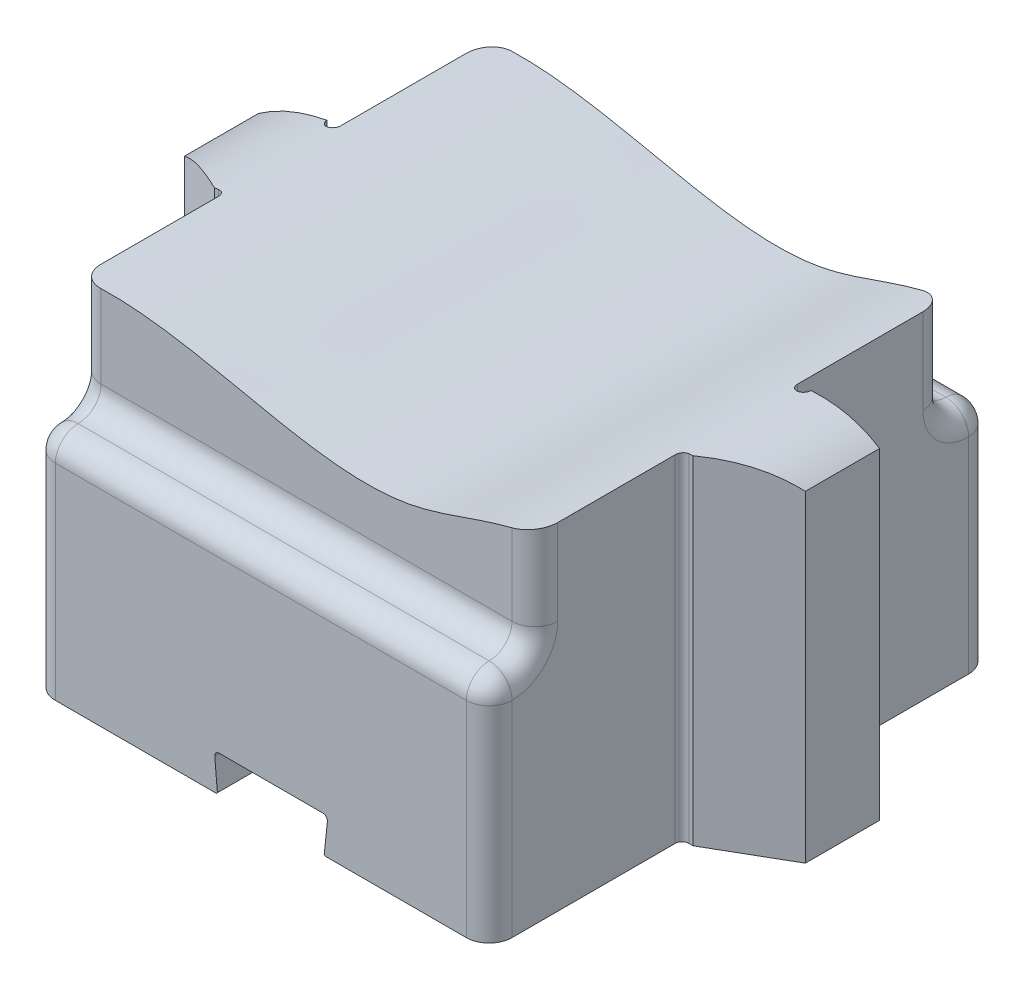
ISO-10303-21;
HEADER;
FILE_DESCRIPTION(('STEP AP214'),'2;1');
FILE_NAME('part.step','',(''),(''),'','','');
FILE_SCHEMA(('AUTOMOTIVE_DESIGN { 1 0 10303 214 1 1 1 1 }'));
ENDSEC;
DATA;
#1=APPLICATION_CONTEXT('core data for automotive mechanical design processes');
#2=APPLICATION_PROTOCOL_DEFINITION('international standard','automotive_design',2000,#1);
#3=PRODUCT_CONTEXT('',#1,'mechanical');
#4=PRODUCT('Part','Part','',(#3));
#5=PRODUCT_RELATED_PRODUCT_CATEGORY('part','',(#4));
#6=PRODUCT_DEFINITION_FORMATION('','',#4);
#7=PRODUCT_DEFINITION_CONTEXT('part definition',#1,'design');
#8=PRODUCT_DEFINITION('design','',#6,#7);
#9=PRODUCT_DEFINITION_SHAPE('','',#8);
#10=(LENGTH_UNIT() NAMED_UNIT(*) SI_UNIT(.MILLI.,.METRE.));
#11=(NAMED_UNIT(*) PLANE_ANGLE_UNIT() SI_UNIT($,.RADIAN.));
#12=(NAMED_UNIT(*) SI_UNIT($,.STERADIAN.) SOLID_ANGLE_UNIT());
#13=UNCERTAINTY_MEASURE_WITH_UNIT(LENGTH_MEASURE(1.E-05),#10,'distance_accuracy_value','');
#14=(GEOMETRIC_REPRESENTATION_CONTEXT(3) GLOBAL_UNCERTAINTY_ASSIGNED_CONTEXT((#13)) GLOBAL_UNIT_ASSIGNED_CONTEXT((#10,
#11,#12)) REPRESENTATION_CONTEXT('',''));
#15=CARTESIAN_POINT('',(0.,0.,0.));
#16=DIRECTION('',(0.,0.,1.));
#17=DIRECTION('',(1.,0.,0.));
#18=AXIS2_PLACEMENT_3D('',#15,#16,#17);
#19=CARTESIAN_POINT('',(-37.711347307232,-3.29931537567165,0.));
#20=DIRECTION('',(-0.996194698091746,-0.0871557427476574,0.));
#21=DIRECTION('',(0.0871557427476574,-0.996194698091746,0.));
#22=AXIS2_PLACEMENT_3D('',#19,#20,#21);
#23=PLANE('',#22);
#24=DIRECTION('',(0.0871557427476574,-0.996194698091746,0.));
#25=VECTOR('',#24,1.);
#26=CARTESIAN_POINT('',(-40.7733906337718,31.7,220.));
#27=LINE('',#26,#25);
#28=CARTESIAN_POINT('',(-40.3929354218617,27.3513770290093,220.));
#29=VERTEX_POINT('',#28);
#30=CARTESIAN_POINT('',(-38.0804501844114,0.919549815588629,220.));
#31=VERTEX_POINT('',#30);
#32=EDGE_CURVE('E894',#29,#31,#27,.T.);
#33=ORIENTED_EDGE('',*,*,#32,.T.);
#34=DIRECTION('',(0.,0.,-1.));
#35=VECTOR('',#34,1.);
#36=CARTESIAN_POINT('',(-38.0804501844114,0.919549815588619,0.));
#37=LINE('',#36,#35);
#38=CARTESIAN_POINT('',(-38.0804501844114,0.919549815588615,6.68369112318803));
#39=VERTEX_POINT('',#38);
#40=EDGE_CURVE('E12',#31,#39,#37,.T.);
#41=ORIENTED_EDGE('',*,*,#40,.T.);
#42=CARTESIAN_POINT('',(-36.,-22.8601046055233,0.));
#43=DIRECTION('',(-0.996194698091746,-0.0871557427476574,0.));
#44=DIRECTION('',(0.0871557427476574,-0.996194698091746,0.));
#45=AXIS2_PLACEMENT_3D('',#42,#43,#44);
#46=ELLIPSE('',#45,80.3159927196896,6.99999999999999);
#47=CARTESIAN_POINT('',(-40.3929354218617,27.3513770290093,5.44996498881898));
#48=VERTEX_POINT('',#47);
#49=EDGE_CURVE('E346',#39,#48,#46,.T.);
#50=ORIENTED_EDGE('',*,*,#49,.T.);
#51=DIRECTION('',(0.,0.,-1.));
#52=VECTOR('',#51,1.);
#53=CARTESIAN_POINT('',(-40.3929354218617,27.3513770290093,220.));
#54=LINE('',#53,#52);
#55=EDGE_CURVE('E882',#48,#29,#54,.F.);
#56=ORIENTED_EDGE('',*,*,#55,.T.);
#57=EDGE_LOOP('',(#33,#41,#50,#56));
#58=FACE_BOUND('',#57,.T.);
#59=ADVANCED_FACE('F47',(#58),#23,.F.);
#60=CARTESIAN_POINT('',(206.,0.,-50.));
#61=DIRECTION('',(0.,1.,0.));
#62=DIRECTION('',(0.,0.,1.));
#63=AXIS2_PLACEMENT_3D('',#60,#61,#62);
#64=PLANE('',#63);
#65=DIRECTION('',(-1.,0.,0.));
#66=VECTOR('',#65,1.);
#67=CARTESIAN_POINT('',(200.,0.,-220.));
#68=LINE('',#67,#66);
#69=CARTESIAN_POINT('',(-38.9230623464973,0.,-220.));
#70=VERTEX_POINT('',#69);
#71=CARTESIAN_POINT('',(-180.,0.,-220.));
#72=VERTEX_POINT('',#71);
#73=EDGE_CURVE('E604',#70,#72,#68,.T.);
#74=ORIENTED_EDGE('',*,*,#73,.F.);
#75=DIRECTION('',(0.,0.,1.));
#76=VECTOR('',#75,1.);
#77=CARTESIAN_POINT('',(-38.9230623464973,0.,-50.));
#78=LINE('',#77,#76);
#79=CARTESIAN_POINT('',(-38.9230623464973,0.,-6.36048005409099));
#80=VERTEX_POINT('',#79);
#81=EDGE_CURVE('E926',#70,#80,#78,.T.);
#82=ORIENTED_EDGE('',*,*,#81,.T.);
#83=CARTESIAN_POINT('',(-36.,0.,0.));
#84=DIRECTION('',(0.,-1.,0.));
#85=DIRECTION('',(0.,0.,-1.));
#86=AXIS2_PLACEMENT_3D('',#83,#84,#85);
#87=CIRCLE('',#86,6.99999999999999);
#88=CARTESIAN_POINT('',(-39.0000000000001,0.,6.32455532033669));
#89=VERTEX_POINT('',#88);
#90=EDGE_CURVE('E343',#89,#80,#87,.T.);
#91=ORIENTED_EDGE('',*,*,#90,.F.);
#92=DIRECTION('',(0.,0.,1.));
#93=VECTOR('',#92,1.);
#94=CARTESIAN_POINT('',(-39.0000000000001,0.,-50.));
#95=LINE('',#94,#93);
#96=CARTESIAN_POINT('',(-39.0000000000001,0.,220.));
#97=VERTEX_POINT('',#96);
#98=EDGE_CURVE('E693',#89,#97,#95,.T.);
#99=ORIENTED_EDGE('',*,*,#98,.T.);
#100=DIRECTION('',(1.,0.,0.));
#101=VECTOR('',#100,1.);
#102=CARTESIAN_POINT('',(200.,0.,220.));
#103=LINE('',#102,#101);
#104=CARTESIAN_POINT('',(-180.,0.,220.));
#105=VERTEX_POINT('',#104);
#106=EDGE_CURVE('E685',#105,#97,#103,.T.);
#107=ORIENTED_EDGE('',*,*,#106,.F.);
#108=CARTESIAN_POINT('',(-180.,0.,200.));
#109=DIRECTION('',(0.,1.,0.));
#110=DIRECTION('',(0.,0.,1.));
#111=AXIS2_PLACEMENT_3D('',#108,#109,#110);
#112=CIRCLE('',#111,20.);
#113=CARTESIAN_POINT('',(-200.,0.,200.));
#114=VERTEX_POINT('',#113);
#115=EDGE_CURVE('E681',#105,#114,#112,.F.);
#116=ORIENTED_EDGE('',*,*,#115,.T.);
#117=DIRECTION('',(0.,0.,1.));
#118=VECTOR('',#117,1.);
#119=CARTESIAN_POINT('',(-200.,0.,220.));
#120=LINE('',#119,#118);
#121=CARTESIAN_POINT('',(-200.,0.,57.));
#122=VERTEX_POINT('',#121);
#123=EDGE_CURVE('E699',#122,#114,#120,.T.);
#124=ORIENTED_EDGE('',*,*,#123,.F.);
#125=CARTESIAN_POINT('',(-206.,0.,57.));
#126=DIRECTION('',(0.,1.,0.));
#127=DIRECTION('',(0.,0.,1.));
#128=AXIS2_PLACEMENT_3D('',#125,#126,#127);
#129=CIRCLE('',#128,6.);
#130=CARTESIAN_POINT('',(-206.,0.,51.));
#131=VERTEX_POINT('',#130);
#132=EDGE_CURVE('E738',#122,#131,#129,.T.);
#133=ORIENTED_EDGE('',*,*,#132,.T.);
#134=DIRECTION('',(1.,0.,0.));
#135=VECTOR('',#134,1.);
#136=CARTESIAN_POINT('',(-209.64617092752,0.,51.));
#137=LINE('',#136,#135);
#138=CARTESIAN_POINT('',(-209.64617092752,0.,51.));
#139=VERTEX_POINT('',#138);
#140=EDGE_CURVE('E1008',#139,#131,#137,.T.);
#141=ORIENTED_EDGE('',*,*,#140,.F.);
#142=DIRECTION('',(0.866025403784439,0.,0.499999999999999));
#143=VECTOR('',#142,1.);
#144=CARTESIAN_POINT('',(-272.,0.,14.9999999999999));
#145=LINE('',#144,#143);
#146=CARTESIAN_POINT('',(-272.,0.,14.9999999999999));
#147=VERTEX_POINT('',#146);
#148=EDGE_CURVE('E1006',#147,#139,#145,.T.);
#149=ORIENTED_EDGE('',*,*,#148,.F.);
#150=DIRECTION('',(0.,0.,1.));
#151=VECTOR('',#150,1.);
#152=CARTESIAN_POINT('',(-272.,0.,-50.));
#153=LINE('',#152,#151);
#154=CARTESIAN_POINT('',(-272.,0.,-50.));
#155=VERTEX_POINT('',#154);
#156=EDGE_CURVE('E1000',#155,#147,#153,.T.);
#157=ORIENTED_EDGE('',*,*,#156,.F.);
#158=DIRECTION('',(-1.,0.,0.));
#159=VECTOR('',#158,1.);
#160=CARTESIAN_POINT('',(-212.,0.,-50.));
#161=LINE('',#160,#159);
#162=CARTESIAN_POINT('',(-212.,0.,-50.));
#163=VERTEX_POINT('',#162);
#164=EDGE_CURVE('E998',#163,#155,#161,.T.);
#165=ORIENTED_EDGE('',*,*,#164,.F.);
#166=CARTESIAN_POINT('',(-206.,0.,-50.));
#167=DIRECTION('',(0.,-1.,0.));
#168=DIRECTION('',(0.,0.,-1.));
#169=AXIS2_PLACEMENT_3D('',#166,#167,#168);
#170=CIRCLE('',#169,5.99999999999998);
#171=CARTESIAN_POINT('',(-200.,0.,-50.));
#172=VERTEX_POINT('',#171);
#173=EDGE_CURVE('E990',#172,#163,#170,.T.);
#174=ORIENTED_EDGE('',*,*,#173,.F.);
#175=DIRECTION('',(0.,0.,1.));
#176=VECTOR('',#175,1.);
#177=CARTESIAN_POINT('',(-200.,0.,-50.));
#178=LINE('',#177,#176);
#179=CARTESIAN_POINT('',(-200.,0.,-200.));
#180=VERTEX_POINT('',#179);
#181=EDGE_CURVE('E814',#180,#172,#178,.T.);
#182=ORIENTED_EDGE('',*,*,#181,.F.);
#183=CARTESIAN_POINT('',(-180.,0.,-200.));
#184=DIRECTION('',(0.,1.,0.));
#185=DIRECTION('',(0.,0.,1.));
#186=AXIS2_PLACEMENT_3D('',#183,#184,#185);
#187=CIRCLE('',#186,20.);
#188=EDGE_CURVE('E622',#180,#72,#187,.F.);
#189=ORIENTED_EDGE('',*,*,#188,.T.);
#190=EDGE_LOOP('',(#74,#82,#91,#99,#107,#116,#124,#133,#141,#149,#157,#165,#174,#182,#189));
#191=FACE_BOUND('',#190,.T.);
#192=ADVANCED_FACE('F564',(#191),#64,.F.);
#193=CARTESIAN_POINT('',(-200.,200.,-50.));
#194=DIRECTION('',(1.,0.,0.));
#195=DIRECTION('',(0.,0.,-1.));
#196=AXIS2_PLACEMENT_3D('',#193,#194,#195);
#197=PLANE('',#196);
#198=DIRECTION('',(0.,0.,-1.));
#199=VECTOR('',#198,1.);
#200=CARTESIAN_POINT('',(-200.000000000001,290.963094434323,1631.59096714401));
#201=LINE('',#200,#199);
#202=CARTESIAN_POINT('',(-200.,290.963094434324,-160.));
#203=VERTEX_POINT('',#202);
#204=CARTESIAN_POINT('',(-200.000000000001,290.963094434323,-49.9999999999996));
#205=VERTEX_POINT('',#204);
#206=EDGE_CURVE('E445',#203,#205,#201,.F.);
#207=ORIENTED_EDGE('',*,*,#206,.F.);
#208=DIRECTION('',(0.,-1.,0.));
#209=VECTOR('',#208,1.);
#210=CARTESIAN_POINT('',(-200.,200.,-160.));
#211=LINE('',#210,#209);
#212=CARTESIAN_POINT('',(-200.,220.,-160.));
#213=VERTEX_POINT('',#212);
#214=EDGE_CURVE('E763',#203,#213,#211,.T.);
#215=ORIENTED_EDGE('',*,*,#214,.T.);
#216=CARTESIAN_POINT('',(-200.,220.,-200.));
#217=DIRECTION('',(1.,0.,0.));
#218=DIRECTION('',(0.,0.,-1.));
#219=AXIS2_PLACEMENT_3D('',#216,#217,#218);
#220=CIRCLE('',#219,40.);
#221=CARTESIAN_POINT('',(-200.,180.,-200.));
#222=VERTEX_POINT('',#221);
#223=EDGE_CURVE('E761',#213,#222,#220,.T.);
#224=ORIENTED_EDGE('',*,*,#223,.T.);
#225=DIRECTION('',(0.,-1.,0.));
#226=VECTOR('',#225,1.);
#227=CARTESIAN_POINT('',(-200.,200.,-200.));
#228=LINE('',#227,#226);
#229=EDGE_CURVE('E759',#222,#180,#228,.T.);
#230=ORIENTED_EDGE('',*,*,#229,.T.);
#231=ORIENTED_EDGE('',*,*,#181,.T.);
#232=DIRECTION('',(0.,-1.,0.));
#233=VECTOR('',#232,1.);
#234=CARTESIAN_POINT('',(-200.,200.,-50.));
#235=LINE('',#234,#233);
#236=EDGE_CURVE('E730',#205,#172,#235,.T.);
#237=ORIENTED_EDGE('',*,*,#236,.F.);
#238=EDGE_LOOP('',(#207,#215,#224,#230,#231,#237));
#239=FACE_BOUND('',#238,.T.);
#240=ADVANCED_FACE('F571',(#239),#197,.F.);
#241=CARTESIAN_POINT('',(-206.,200.,-50.));
#242=DIRECTION('',(0.,-1.,0.));
#243=DIRECTION('',(0.,0.,-1.));
#244=AXIS2_PLACEMENT_3D('',#241,#242,#243);
#245=CYLINDRICAL_SURFACE('',#244,5.99999999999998);
#246=CARTESIAN_POINT('',(-200.,290.963094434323,-50.));
#247=CARTESIAN_POINT('',(-199.999981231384,290.963095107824,-49.8322198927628));
#248=CARTESIAN_POINT('',(-200.007036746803,290.962235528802,-49.6644427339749));
#249=CARTESIAN_POINT('',(-200.035160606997,290.958800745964,-49.3300942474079));
#250=CARTESIAN_POINT('',(-200.056228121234,290.956225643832,-49.163522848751));
#251=CARTESIAN_POINT('',(-200.11221570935,290.949367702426,-48.8329106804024));
#252=CARTESIAN_POINT('',(-200.14712361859,290.945086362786,-48.6688678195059));
#253=CARTESIAN_POINT('',(-200.230526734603,290.934825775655,-48.3443297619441));
#254=CARTESIAN_POINT('',(-200.279021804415,290.928846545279,-48.1838345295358));
#255=CARTESIAN_POINT('',(-200.389254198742,290.915202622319,-47.8674908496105));
#256=CARTESIAN_POINT('',(-200.450994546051,290.907537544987,-47.7116434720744));
#257=CARTESIAN_POINT('',(-200.587279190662,290.89053882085,-47.4056772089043));
#258=CARTESIAN_POINT('',(-200.661828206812,290.881204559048,-47.2555604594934));
#259=CARTESIAN_POINT('',(-200.823121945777,290.86089993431,-46.9622490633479));
#260=CARTESIAN_POINT('',(-200.909860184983,290.849930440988,-46.8190507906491));
#261=CARTESIAN_POINT('',(-201.094959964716,290.826379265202,-46.5404387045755));
#262=CARTESIAN_POINT('',(-201.193325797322,290.813796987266,-46.4050277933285));
#263=CARTESIAN_POINT('',(-201.401181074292,290.787031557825,-46.142677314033));
#264=CARTESIAN_POINT('',(-201.510696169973,290.772844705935,-46.0157584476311));
#265=CARTESIAN_POINT('',(-201.739899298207,290.742937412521,-45.7715732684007));
#266=CARTESIAN_POINT('',(-201.859591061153,290.727216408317,-45.6543105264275));
#267=CARTESIAN_POINT('',(-202.10821909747,290.694306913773,-45.4303136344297));
#268=CARTESIAN_POINT('',(-202.237153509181,290.677118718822,-45.3235773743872));
#269=CARTESIAN_POINT('',(-202.503408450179,290.641334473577,-45.1212900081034));
#270=CARTESIAN_POINT('',(-202.640732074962,290.622737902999,-45.0257430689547));
#271=CARTESIAN_POINT('',(-202.923684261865,290.584093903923,-44.8459172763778));
#272=CARTESIAN_POINT('',(-203.069362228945,290.564037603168,-44.7617180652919));
#273=CARTESIAN_POINT('',(-203.367185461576,290.522671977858,-44.605878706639));
#274=CARTESIAN_POINT('',(-203.5193330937,290.501362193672,-44.5342432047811));
#275=CARTESIAN_POINT('',(-203.8288999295,290.457612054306,-44.4040632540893));
#276=CARTESIAN_POINT('',(-203.986317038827,290.435172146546,-44.3455136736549));
#277=CARTESIAN_POINT('',(-204.305426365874,290.389265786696,-44.2418252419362));
#278=CARTESIAN_POINT('',(-204.467120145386,290.36579895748,-44.1966913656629));
#279=CARTESIAN_POINT('',(-204.795060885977,290.317765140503,-44.1198010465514));
#280=CARTESIAN_POINT('',(-204.96133568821,290.293190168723,-44.0881683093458));
#281=CARTESIAN_POINT('',(-205.295909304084,290.243280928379,-44.0390558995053));
#282=CARTESIAN_POINT('',(-205.464208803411,290.217946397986,-44.0215811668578));
#283=CARTESIAN_POINT('',(-205.801575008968,290.166692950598,-44.0009012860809));
#284=CARTESIAN_POINT('',(-205.970641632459,290.140774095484,-43.9976946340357));
#285=CARTESIAN_POINT('',(-206.308379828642,290.088526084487,-44.005549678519));
#286=CARTESIAN_POINT('',(-206.477051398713,290.062196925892,-44.0166114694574));
#287=CARTESIAN_POINT('',(-206.814253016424,290.00909234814,-44.0530685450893));
#288=CARTESIAN_POINT('',(-206.982769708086,289.982315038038,-44.0785847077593));
#289=CARTESIAN_POINT('',(-207.316962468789,289.928748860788,-44.1438420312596));
#290=CARTESIAN_POINT('',(-207.482639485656,289.90196000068,-44.183578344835));
#291=CARTESIAN_POINT('',(-207.810108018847,289.848565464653,-44.2770189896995));
#292=CARTESIAN_POINT('',(-207.971898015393,289.821959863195,-44.3307286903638));
#293=CARTESIAN_POINT('',(-208.290323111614,289.769174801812,-44.4517193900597));
#294=CARTESIAN_POINT('',(-208.446960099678,289.742995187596,-44.5189953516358));
#295=CARTESIAN_POINT('',(-208.754477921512,289.691205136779,-44.666891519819));
#296=CARTESIAN_POINT('',(-208.905340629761,289.665596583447,-44.7475500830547));
#297=CARTESIAN_POINT('',(-209.199682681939,289.615272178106,-44.921492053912));
#298=CARTESIAN_POINT('',(-209.343164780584,289.590555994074,-45.0147707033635));
#299=CARTESIAN_POINT('',(-209.621806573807,289.542234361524,-45.2133730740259));
#300=CARTESIAN_POINT('',(-209.756963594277,289.51862927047,-45.318700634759));
#301=CARTESIAN_POINT('',(-210.017856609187,289.472781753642,-45.5406117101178));
#302=CARTESIAN_POINT('',(-210.143596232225,289.450538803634,-45.6571908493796));
#303=CARTESIAN_POINT('',(-210.383960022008,289.407779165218,-45.9000142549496));
#304=CARTESIAN_POINT('',(-210.498653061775,289.387251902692,-46.0261884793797));
#305=CARTESIAN_POINT('',(-210.716964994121,289.347982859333,-46.2879554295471));
#306=CARTESIAN_POINT('',(-210.820588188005,289.329240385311,-46.4235444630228));
#307=CARTESIAN_POINT('',(-211.016081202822,289.293724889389,-46.7033241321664));
#308=CARTESIAN_POINT('',(-211.107943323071,289.276953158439,-46.8475203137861));
#309=CARTESIAN_POINT('',(-211.279083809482,289.245588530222,-47.1433476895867));
#310=CARTESIAN_POINT('',(-211.35836713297,289.230994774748,-47.2949759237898));
#311=CARTESIAN_POINT('',(-211.502767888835,289.204331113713,-47.6025000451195));
#312=CARTESIAN_POINT('',(-211.568064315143,289.192229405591,-47.7583091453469));
#313=CARTESIAN_POINT('',(-211.685309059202,289.170446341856,-48.0749669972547));
#314=CARTESIAN_POINT('',(-211.73726271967,289.160764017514,-48.2358137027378));
#315=CARTESIAN_POINT('',(-211.827386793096,289.143937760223,-48.5612373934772));
#316=CARTESIAN_POINT('',(-211.865573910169,289.136790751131,-48.725809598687));
#317=CARTESIAN_POINT('',(-211.927931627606,289.125106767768,-49.0576103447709));
#318=CARTESIAN_POINT('',(-211.952109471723,289.120568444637,-49.2248374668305));
#319=CARTESIAN_POINT('',(-211.979462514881,289.11543163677,-49.4937114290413));
#320=CARTESIAN_POINT('',(-211.987168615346,289.113983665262,-49.59490275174));
#321=CARTESIAN_POINT('',(-211.997433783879,289.112054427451,-49.7973922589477));
#322=CARTESIAN_POINT('',(-212.000001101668,289.111571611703,-49.8986900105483));
#323=CARTESIAN_POINT('',(-212.,289.111572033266,-50.));
#324=B_SPLINE_CURVE_WITH_KNOTS('',3,(#246,#247,#248,#249,#250,#251,#252,#253,#254,#255,#256,
#257,#258,#259,#260,#261,#262,#263,#264,#265,#266,#267,#268,#269,#270,#271,#272,#273,#274,#275,
#276,#277,#278,#279,#280,#281,#282,#283,#284,#285,#286,#287,#288,#289,#290,#291,#292,#293,#294,
#295,#296,#297,#298,#299,#300,#301,#302,#303,#304,#305,#306,#307,#308,#309,#310,#311,#312,#313,
#314,#315,#316,#317,#318,#319,#320,#321,#322,#323),.UNSPECIFIED.,.F.,.F.,(4,2,2,2,2,2,2,2,2,2,2,
2,2,2,2,2,2,2,2,2,2,2,2,2,2,2,2,2,2,2,2,2,2,2,2,2,2,2,4),(0.,0.50318561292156,1.00634140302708,
1.50905593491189,2.01176539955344,2.51458971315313,3.01759967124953,3.52034307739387,
4.02327264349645,4.52738664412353,5.03168623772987,5.53588453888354,6.04027001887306,
6.54802913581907,7.05597561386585,7.5637225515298,8.07165754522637,8.58415152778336,
9.09682425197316,9.60944293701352,10.1220650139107,10.6390386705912,11.1558362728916,
11.6728327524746,12.1896376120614,12.7079501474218,13.2260678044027,13.7443510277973,
14.2624335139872,14.7770424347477,15.2914506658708,15.8061940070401,16.3207339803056,
16.8282332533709,17.3355289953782,17.8422071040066,18.3486229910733,18.6529839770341,
18.9568559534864),.UNSPECIFIED.);
#325=CARTESIAN_POINT('',(-212.,289.111572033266,-50.));
#326=VERTEX_POINT('',#325);
#327=EDGE_CURVE('E992',#205,#326,#324,.T.);
#328=ORIENTED_EDGE('',*,*,#327,.F.);
#329=ORIENTED_EDGE('',*,*,#236,.T.);
#330=ORIENTED_EDGE('',*,*,#173,.T.);
#331=DIRECTION('',(0.,-1.,0.));
#332=VECTOR('',#331,1.);
#333=CARTESIAN_POINT('',(-212.,200.,-50.));
#334=LINE('',#333,#332);
#335=EDGE_CURVE('E983',#326,#163,#334,.T.);
#336=ORIENTED_EDGE('',*,*,#335,.F.);
#337=EDGE_LOOP('',(#328,#329,#330,#336));
#338=FACE_BOUND('',#337,.T.);
#339=ADVANCED_FACE('F988',(#338),#245,.F.);
#340=CARTESIAN_POINT('',(-212.,200.,-50.));
#341=DIRECTION('',(0.,0.,1.));
#342=DIRECTION('',(1.,0.,0.));
#343=AXIS2_PLACEMENT_3D('',#340,#341,#342);
#344=PLANE('',#343);
#345=CARTESIAN_POINT('',(-272.,264.375364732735,-49.9999999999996));
#346=CARTESIAN_POINT('',(-217.133060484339,302.667187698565,-49.9999999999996));
#347=CARTESIAN_POINT('',(-87.5867989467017,287.864520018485,-49.9999999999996));
#348=CARTESIAN_POINT('',(67.0623995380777,244.402902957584,-49.9999999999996));
#349=CARTESIAN_POINT('',(179.396686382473,297.417283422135,-49.9999999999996));
#350=CARTESIAN_POINT('',(244.259973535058,300.000657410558,-49.9999999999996));
#351=CARTESIAN_POINT('',(272.,282.122323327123,-49.9999999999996));
#352=B_SPLINE_CURVE_WITH_KNOTS('',3,(#345,#346,#347,#348,#349,#350,#351),.UNSPECIFIED.,.F.,.F.,
(4,1,1,1,4),(0.,0.346968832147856,0.665766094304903,0.830927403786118,1.),.UNSPECIFIED.);
#353=CARTESIAN_POINT('',(-272.,264.375364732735,-49.9999999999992));
#354=VERTEX_POINT('',#353);
#355=EDGE_CURVE('E669',#326,#354,#352,.F.);
#356=ORIENTED_EDGE('',*,*,#355,.F.);
#357=ORIENTED_EDGE('',*,*,#335,.T.);
#358=ORIENTED_EDGE('',*,*,#164,.T.);
#359=DIRECTION('',(0.,-1.,0.));
#360=VECTOR('',#359,1.);
#361=CARTESIAN_POINT('',(-272.,200.,-50.));
#362=LINE('',#361,#360);
#363=EDGE_CURVE('E981',#354,#155,#362,.T.);
#364=ORIENTED_EDGE('',*,*,#363,.F.);
#365=EDGE_LOOP('',(#356,#357,#358,#364));
#366=FACE_BOUND('',#365,.T.);
#367=ADVANCED_FACE('F1026',(#366),#344,.F.);
#368=CARTESIAN_POINT('',(-272.,200.,-50.));
#369=DIRECTION('',(1.,0.,0.));
#370=DIRECTION('',(0.,0.,-1.));
#371=AXIS2_PLACEMENT_3D('',#368,#369,#370);
#372=PLANE('',#371);
#373=DIRECTION('',(0.,0.,-1.));
#374=VECTOR('',#373,1.);
#375=CARTESIAN_POINT('',(-272.,264.375364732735,1631.59096714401));
#376=LINE('',#375,#374);
#377=CARTESIAN_POINT('',(-272.,264.375364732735,15.0000000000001));
#378=VERTEX_POINT('',#377);
#379=EDGE_CURVE('E872',#378,#354,#376,.T.);
#380=ORIENTED_EDGE('',*,*,#379,.T.);
#381=ORIENTED_EDGE('',*,*,#363,.T.);
#382=ORIENTED_EDGE('',*,*,#156,.T.);
#383=DIRECTION('',(0.,-1.,0.));
#384=VECTOR('',#383,1.);
#385=CARTESIAN_POINT('',(-272.,200.,14.9999999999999));
#386=LINE('',#385,#384);
#387=EDGE_CURVE('E974',#378,#147,#386,.T.);
#388=ORIENTED_EDGE('',*,*,#387,.F.);
#389=EDGE_LOOP('',(#380,#381,#382,#388));
#390=FACE_BOUND('',#389,.T.);
#391=ADVANCED_FACE('F1023',(#390),#372,.F.);
#392=CARTESIAN_POINT('',(-272.,200.,14.9999999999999));
#393=DIRECTION('',(0.499999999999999,0.,-0.866025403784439));
#394=DIRECTION('',(-0.866025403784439,0.,-0.499999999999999));
#395=AXIS2_PLACEMENT_3D('',#392,#393,#394);
#396=PLANE('',#395);
#397=CARTESIAN_POINT('',(-272.,264.375364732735,14.9999999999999));
#398=CARTESIAN_POINT('',(-271.281515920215,264.876799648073,15.4148169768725));
#399=CARTESIAN_POINT('',(-270.55943853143,265.371334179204,15.8317085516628));
#400=CARTESIAN_POINT('',(-269.108279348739,266.346501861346,16.6695356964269));
#401=CARTESIAN_POINT('',(-268.379197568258,266.827135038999,17.0904712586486));
#402=CARTESIAN_POINT('',(-266.182592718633,268.247466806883,18.3586816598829));
#403=CARTESIAN_POINT('',(-264.704848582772,269.166198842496,19.2118576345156));
#404=CARTESIAN_POINT('',(-261.724522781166,270.946667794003,20.9325495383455));
#405=CARTESIAN_POINT('',(-260.22194991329,271.808424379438,21.8000603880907));
#406=CARTESIAN_POINT('',(-257.193526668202,273.474842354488,23.5485213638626));
#407=CARTESIAN_POINT('',(-255.667679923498,274.279512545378,24.4294693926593));
#408=CARTESIAN_POINT('',(-252.594413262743,275.831857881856,26.2038207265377));
#409=CARTESIAN_POINT('',(-251.046993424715,276.579533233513,27.0972239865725));
#410=CARTESIAN_POINT('',(-247.953656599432,278.00839237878,28.8831628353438));
#411=CARTESIAN_POINT('',(-246.408004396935,278.69034104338,29.7755455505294));
#412=CARTESIAN_POINT('',(-243.299349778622,279.999610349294,31.5703281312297));
#413=CARTESIAN_POINT('',(-241.736346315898,280.626927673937,32.4727286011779));
#414=CARTESIAN_POINT('',(-238.594881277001,281.827674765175,34.2864542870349));
#415=CARTESIAN_POINT('',(-237.016419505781,282.401103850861,35.1977796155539));
#416=CARTESIAN_POINT('',(-233.845994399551,283.495013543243,37.0282254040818));
#417=CARTESIAN_POINT('',(-232.254032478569,284.015499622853,37.9473450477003));
#418=CARTESIAN_POINT('',(-229.058573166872,285.00465940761,39.7922443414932));
#419=CARTESIAN_POINT('',(-227.455079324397,285.473348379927,40.7180219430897));
#420=CARTESIAN_POINT('',(-225.178921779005,286.100946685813,42.0321621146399));
#421=CARTESIAN_POINT('',(-224.510514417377,286.280670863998,42.4180672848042));
#422=CARTESIAN_POINT('',(-223.172119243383,286.631546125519,43.1907900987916));
#423=CARTESIAN_POINT('',(-222.502131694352,286.802698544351,43.5776075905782));
#424=CARTESIAN_POINT('',(-221.16064904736,287.136551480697,44.3521129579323));
#425=CARTESIAN_POINT('',(-220.489154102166,287.299252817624,44.7398007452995));
#426=CARTESIAN_POINT('',(-219.144721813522,287.616328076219,45.5160090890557));
#427=CARTESIAN_POINT('',(-218.471784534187,287.770702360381,45.9045296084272));
#428=CARTESIAN_POINT('',(-217.121415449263,288.071943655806,46.6841655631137));
#429=CARTESIAN_POINT('',(-216.443977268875,288.218772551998,47.0752846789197));
#430=CARTESIAN_POINT('',(-215.087781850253,288.50427750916,47.858284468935));
#431=CARTESIAN_POINT('',(-214.409024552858,288.642953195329,48.2501651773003));
#432=CARTESIAN_POINT('',(-213.050260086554,288.91227852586,49.0346482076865));
#433=CARTESIAN_POINT('',(-212.370252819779,289.04292751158,49.42725058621));
#434=CARTESIAN_POINT('',(-211.009056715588,289.296327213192,50.213137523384));
#435=CARTESIAN_POINT('',(-210.327867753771,289.419077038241,50.6064221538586));
#436=CARTESIAN_POINT('',(-209.64617092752,289.53793265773,51.0000000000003));
#437=B_SPLINE_CURVE_WITH_KNOTS('',3,(#397,#398,#399,#400,#401,#402,#403,#404,#405,#406,#407,
#408,#409,#410,#411,#412,#413,#414,#415,#416,#417,#418,#419,#420,#421,#422,#423,#424,#425,#426,
#427,#428,#429,#430,#431,#432,#433,#434,#435,#436),.UNSPECIFIED.,.F.,.F.,(4,2,2,2,2,2,2,2,2,2,2,
2,2,2,2,2,2,2,2,4),(0.,2.90811941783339,5.81623326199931,11.6289755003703,17.4397004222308,
23.2495275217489,29.0593336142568,34.790267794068,40.5215496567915,46.2529039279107,
51.9836651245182,57.7127326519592,60.0900757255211,62.4670472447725,64.8437878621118,
67.2204249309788,69.6080783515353,71.9958414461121,74.3838002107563,76.7720278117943),.UNSPECIFIED.);
#438=CARTESIAN_POINT('',(-209.646170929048,289.537932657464,51.0000000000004));
#439=VERTEX_POINT('',#438);
#440=EDGE_CURVE('E400',#378,#439,#437,.T.);
#441=ORIENTED_EDGE('',*,*,#440,.F.);
#442=ORIENTED_EDGE('',*,*,#387,.T.);
#443=ORIENTED_EDGE('',*,*,#148,.T.);
#444=DIRECTION('',(0.,-1.,0.));
#445=VECTOR('',#444,1.);
#446=CARTESIAN_POINT('',(-209.64617092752,200.,51.));
#447=LINE('',#446,#445);
#448=EDGE_CURVE('E971',#439,#139,#447,.T.);
#449=ORIENTED_EDGE('',*,*,#448,.F.);
#450=EDGE_LOOP('',(#441,#442,#443,#449));
#451=FACE_BOUND('',#450,.T.);
#452=ADVANCED_FACE('F1022',(#451),#396,.F.);
#453=CARTESIAN_POINT('',(-209.64617092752,200.,51.));
#454=DIRECTION('',(0.,0.,-1.));
#455=DIRECTION('',(-1.,0.,0.));
#456=AXIS2_PLACEMENT_3D('',#453,#454,#455);
#457=PLANE('',#456);
#458=CARTESIAN_POINT('',(-272.,264.375364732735,51.0000000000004));
#459=CARTESIAN_POINT('',(-217.133060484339,302.667187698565,51.0000000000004));
#460=CARTESIAN_POINT('',(-87.5867989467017,287.864520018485,51.0000000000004));
#461=CARTESIAN_POINT('',(67.0623995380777,244.402902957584,51.0000000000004));
#462=CARTESIAN_POINT('',(179.396686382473,297.417283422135,51.0000000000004));
#463=CARTESIAN_POINT('',(244.259973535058,300.000657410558,51.0000000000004));
#464=CARTESIAN_POINT('',(272.,282.122323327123,51.0000000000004));
#465=B_SPLINE_CURVE_WITH_KNOTS('',3,(#458,#459,#460,#461,#462,#463,#464),.UNSPECIFIED.,.F.,.F.,
(4,1,1,1,4),(0.,0.346968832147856,0.665766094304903,0.830927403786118,1.),.UNSPECIFIED.);
#466=CARTESIAN_POINT('',(-206.,290.136178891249,51.));
#467=VERTEX_POINT('',#466);
#468=EDGE_CURVE('E852',#439,#467,#465,.T.);
#469=ORIENTED_EDGE('',*,*,#468,.F.);
#470=ORIENTED_EDGE('',*,*,#448,.T.);
#471=ORIENTED_EDGE('',*,*,#140,.T.);
#472=DIRECTION('',(0.,-1.,0.));
#473=VECTOR('',#472,1.);
#474=CARTESIAN_POINT('',(-206.,200.,51.));
#475=LINE('',#474,#473);
#476=EDGE_CURVE('E729',#131,#467,#475,.F.);
#477=ORIENTED_EDGE('',*,*,#476,.T.);
#478=EDGE_LOOP('',(#469,#470,#471,#477));
#479=FACE_BOUND('',#478,.T.);
#480=ADVANCED_FACE('F1019',(#479),#457,.F.);
#481=CARTESIAN_POINT('',(-200.,200.,220.));
#482=DIRECTION('',(1.,0.,0.));
#483=DIRECTION('',(0.,0.,-1.));
#484=AXIS2_PLACEMENT_3D('',#481,#482,#483);
#485=PLANE('',#484);
#486=DIRECTION('',(0.,0.,-1.));
#487=VECTOR('',#486,1.);
#488=CARTESIAN_POINT('',(-200.,290.963094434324,1631.59096714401));
#489=LINE('',#488,#487);
#490=CARTESIAN_POINT('',(-200.,290.963094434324,57.0000000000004));
#491=VERTEX_POINT('',#490);
#492=CARTESIAN_POINT('',(-200.,290.963094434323,160.));
#493=VERTEX_POINT('',#492);
#494=EDGE_CURVE('E864',#491,#493,#489,.F.);
#495=ORIENTED_EDGE('',*,*,#494,.F.);
#496=DIRECTION('',(0.,-1.,0.));
#497=VECTOR('',#496,1.);
#498=CARTESIAN_POINT('',(-200.,0.,57.));
#499=LINE('',#498,#497);
#500=EDGE_CURVE('E727',#491,#122,#499,.T.);
#501=ORIENTED_EDGE('',*,*,#500,.T.);
#502=ORIENTED_EDGE('',*,*,#123,.T.);
#503=DIRECTION('',(0.,-1.,0.));
#504=VECTOR('',#503,1.);
#505=CARTESIAN_POINT('',(-200.,200.,200.));
#506=LINE('',#505,#504);
#507=CARTESIAN_POINT('',(-200.,180.,200.));
#508=VERTEX_POINT('',#507);
#509=EDGE_CURVE('E680',#114,#508,#506,.F.);
#510=ORIENTED_EDGE('',*,*,#509,.T.);
#511=CARTESIAN_POINT('',(-200.,220.,200.));
#512=DIRECTION('',(1.,0.,0.));
#513=DIRECTION('',(0.,0.,-1.));
#514=AXIS2_PLACEMENT_3D('',#511,#512,#513);
#515=CIRCLE('',#514,40.);
#516=CARTESIAN_POINT('',(-200.,220.,160.));
#517=VERTEX_POINT('',#516);
#518=EDGE_CURVE('E803',#508,#517,#515,.T.);
#519=ORIENTED_EDGE('',*,*,#518,.T.);
#520=DIRECTION('',(0.,-1.,0.));
#521=VECTOR('',#520,1.);
#522=CARTESIAN_POINT('',(-200.,200.,160.));
#523=LINE('',#522,#521);
#524=EDGE_CURVE('E703',#517,#493,#523,.F.);
#525=ORIENTED_EDGE('',*,*,#524,.T.);
#526=EDGE_LOOP('',(#495,#501,#502,#510,#519,#525));
#527=FACE_BOUND('',#526,.T.);
#528=ADVANCED_FACE('F1013',(#527),#485,.F.);
#529=CARTESIAN_POINT('',(200.,200.,220.));
#530=DIRECTION('',(-1.,0.,0.));
#531=DIRECTION('',(0.,0.,1.));
#532=AXIS2_PLACEMENT_3D('',#529,#530,#531);
#533=PLANE('',#532);
#534=DIRECTION('',(0.,0.,-1.));
#535=VECTOR('',#534,1.);
#536=CARTESIAN_POINT('',(200.000000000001,294.908550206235,1631.59096714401));
#537=LINE('',#536,#535);
#538=CARTESIAN_POINT('',(200.,294.908550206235,160.));
#539=VERTEX_POINT('',#538);
#540=CARTESIAN_POINT('',(200.000000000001,294.908550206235,57.0000000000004));
#541=VERTEX_POINT('',#540);
#542=EDGE_CURVE('E855',#539,#541,#537,.T.);
#543=ORIENTED_EDGE('',*,*,#542,.F.);
#544=DIRECTION('',(0.,-1.,0.));
#545=VECTOR('',#544,1.);
#546=CARTESIAN_POINT('',(200.,200.,160.));
#547=LINE('',#546,#545);
#548=CARTESIAN_POINT('',(200.,220.,160.));
#549=VERTEX_POINT('',#548);
#550=EDGE_CURVE('E789',#539,#549,#547,.T.);
#551=ORIENTED_EDGE('',*,*,#550,.T.);
#552=CARTESIAN_POINT('',(200.,220.,200.));
#553=DIRECTION('',(-1.,0.,0.));
#554=DIRECTION('',(0.,0.,1.));
#555=AXIS2_PLACEMENT_3D('',#552,#553,#554);
#556=CIRCLE('',#555,40.);
#557=CARTESIAN_POINT('',(200.,180.,200.));
#558=VERTEX_POINT('',#557);
#559=EDGE_CURVE('E787',#549,#558,#556,.T.);
#560=ORIENTED_EDGE('',*,*,#559,.T.);
#561=DIRECTION('',(0.,-1.,0.));
#562=VECTOR('',#561,1.);
#563=CARTESIAN_POINT('',(200.,200.,200.));
#564=LINE('',#563,#562);
#565=CARTESIAN_POINT('',(200.,0.,200.));
#566=VERTEX_POINT('',#565);
#567=EDGE_CURVE('E785',#558,#566,#564,.T.);
#568=ORIENTED_EDGE('',*,*,#567,.T.);
#569=DIRECTION('',(0.,0.,-1.));
#570=VECTOR('',#569,1.);
#571=CARTESIAN_POINT('',(200.,0.,220.));
#572=LINE('',#571,#570);
#573=CARTESIAN_POINT('',(200.,0.,57.));
#574=VERTEX_POINT('',#573);
#575=EDGE_CURVE('E694',#566,#574,#572,.T.);
#576=ORIENTED_EDGE('',*,*,#575,.T.);
#577=DIRECTION('',(0.,-1.,0.));
#578=VECTOR('',#577,1.);
#579=CARTESIAN_POINT('',(200.,200.,57.));
#580=LINE('',#579,#578);
#581=EDGE_CURVE('E735',#574,#541,#580,.F.);
#582=ORIENTED_EDGE('',*,*,#581,.T.);
#583=EDGE_LOOP('',(#543,#551,#560,#568,#576,#582));
#584=FACE_BOUND('',#583,.T.);
#585=ADVANCED_FACE('F956',(#584),#533,.F.);
#586=CARTESIAN_POINT('',(209.64617092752,200.,51.));
#587=DIRECTION('',(0.,0.,-1.));
#588=DIRECTION('',(-1.,0.,0.));
#589=AXIS2_PLACEMENT_3D('',#586,#587,#588);
#590=PLANE('',#589);
#591=CARTESIAN_POINT('',(-272.,264.375364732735,51.0000000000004));
#592=CARTESIAN_POINT('',(-217.133060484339,302.667187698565,51.0000000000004));
#593=CARTESIAN_POINT('',(-87.5867989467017,287.864520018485,51.0000000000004));
#594=CARTESIAN_POINT('',(67.0623995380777,244.402902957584,51.0000000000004));
#595=CARTESIAN_POINT('',(179.396686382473,297.417283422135,51.0000000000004));
#596=CARTESIAN_POINT('',(244.259973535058,300.000657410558,51.0000000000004));
#597=CARTESIAN_POINT('',(272.,282.122323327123,51.0000000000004));
#598=B_SPLINE_CURVE_WITH_KNOTS('',3,(#591,#592,#593,#594,#595,#596,#597),.UNSPECIFIED.,.F.,.F.,
(4,1,1,1,4),(0.,0.346968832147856,0.665766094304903,0.830927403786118,1.),.UNSPECIFIED.);
#599=CARTESIAN_POINT('',(206.,295.639732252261,51.));
#600=VERTEX_POINT('',#599);
#601=CARTESIAN_POINT('',(209.646170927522,295.969125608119,51.0000000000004));
#602=VERTEX_POINT('',#601);
#603=EDGE_CURVE('E842',#600,#602,#598,.T.);
#604=ORIENTED_EDGE('',*,*,#603,.F.);
#605=DIRECTION('',(0.,-1.,0.));
#606=VECTOR('',#605,1.);
#607=CARTESIAN_POINT('',(206.,0.,51.));
#608=LINE('',#607,#606);
#609=CARTESIAN_POINT('',(206.,0.,51.));
#610=VERTEX_POINT('',#609);
#611=EDGE_CURVE('E733',#600,#610,#608,.T.);
#612=ORIENTED_EDGE('',*,*,#611,.T.);
#613=DIRECTION('',(1.,0.,0.));
#614=VECTOR('',#613,1.);
#615=CARTESIAN_POINT('',(209.64617092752,0.,51.));
#616=LINE('',#615,#614);
#617=CARTESIAN_POINT('',(209.64617092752,0.,51.));
#618=VERTEX_POINT('',#617);
#619=EDGE_CURVE('E697',#610,#618,#616,.T.);
#620=ORIENTED_EDGE('',*,*,#619,.T.);
#621=DIRECTION('',(0.,-1.,0.));
#622=VECTOR('',#621,1.);
#623=CARTESIAN_POINT('',(209.64617092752,200.,51.));
#624=LINE('',#623,#622);
#625=EDGE_CURVE('E968',#602,#618,#624,.T.);
#626=ORIENTED_EDGE('',*,*,#625,.F.);
#627=EDGE_LOOP('',(#604,#612,#620,#626));
#628=FACE_BOUND('',#627,.T.);
#629=ADVANCED_FACE('F965',(#628),#590,.F.);
#630=CARTESIAN_POINT('',(272.,200.,14.9999999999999));
#631=DIRECTION('',(-0.499999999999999,0.,-0.866025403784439));
#632=DIRECTION('',(-0.866025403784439,0.,0.499999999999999));
#633=AXIS2_PLACEMENT_3D('',#630,#631,#632);
#634=PLANE('',#633);
#635=CARTESIAN_POINT('',(209.64617092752,295.969125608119,51.));
#636=CARTESIAN_POINT('',(210.773426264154,296.056943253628,50.3491788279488));
#637=CARTESIAN_POINT('',(211.901476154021,296.131627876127,49.6978989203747));
#638=CARTESIAN_POINT('',(214.160955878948,296.253472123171,48.39338769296));
#639=CARTESIAN_POINT('',(215.292387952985,296.300576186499,47.7401550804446));
#640=CARTESIAN_POINT('',(217.557480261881,296.365682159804,46.4324034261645));
#641=CARTESIAN_POINT('',(218.691141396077,296.383643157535,45.7778838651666));
#642=CARTESIAN_POINT('',(220.959520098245,296.388898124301,44.4682348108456));
#643=CARTESIAN_POINT('',(222.094237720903,296.376165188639,43.8131052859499));
#644=CARTESIAN_POINT('',(224.363561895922,296.318497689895,42.5029103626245));
#645=CARTESIAN_POINT('',(225.498168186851,296.273549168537,41.8478451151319));
#646=CARTESIAN_POINT('',(227.766101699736,296.149947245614,40.538453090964));
#647=CARTESIAN_POINT('',(228.899428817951,296.071291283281,39.8841263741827));
#648=CARTESIAN_POINT('',(231.132938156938,295.881418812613,38.5946091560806));
#649=CARTESIAN_POINT('',(232.233180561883,295.771149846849,37.9593839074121));
#650=CARTESIAN_POINT('',(234.430247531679,295.516016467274,36.6909067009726));
#651=CARTESIAN_POINT('',(235.527073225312,295.371165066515,36.0576540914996));
#652=CARTESIAN_POINT('',(237.716227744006,295.045603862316,34.793745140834));
#653=CARTESIAN_POINT('',(238.808558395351,294.864910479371,34.1630877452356));
#654=CARTESIAN_POINT('',(240.987652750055,294.466451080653,32.9049870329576));
#655=CARTESIAN_POINT('',(242.074418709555,294.248701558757,32.2775424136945));
#656=CARTESIAN_POINT('',(244.241315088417,293.774972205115,31.0264842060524));
#657=CARTESIAN_POINT('',(245.321447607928,293.519005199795,30.4028694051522));
#658=CARTESIAN_POINT('',(247.47403711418,292.967735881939,29.1600712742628));
#659=CARTESIAN_POINT('',(248.546495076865,292.67243866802,28.5408873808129));
#660=CARTESIAN_POINT('',(250.387671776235,292.12861762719,27.4778835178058));
#661=CARTESIAN_POINT('',(251.158523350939,291.88968036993,27.0328321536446));
#662=CARTESIAN_POINT('',(252.695048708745,291.390355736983,26.1457188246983));
#663=CARTESIAN_POINT('',(253.460722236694,291.129967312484,25.7036570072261));
#664=CARTESIAN_POINT('',(254.986269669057,290.587491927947,24.8228817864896));
#665=CARTESIAN_POINT('',(255.746143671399,290.305405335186,24.3841683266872));
#666=CARTESIAN_POINT('',(257.259493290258,289.719331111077,23.5104355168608));
#667=CARTESIAN_POINT('',(258.012969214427,289.415344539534,23.0754159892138));
#668=CARTESIAN_POINT('',(259.512934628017,288.785318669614,22.2094105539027));
#669=CARTESIAN_POINT('',(260.25942445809,288.459280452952,21.778424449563));
#670=CARTESIAN_POINT('',(261.75721421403,287.779436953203,20.9136751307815));
#671=CARTESIAN_POINT('',(262.508387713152,287.425260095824,20.4799849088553));
#672=CARTESIAN_POINT('',(264.002334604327,286.693962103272,19.6174542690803));
#673=CARTESIAN_POINT('',(264.745107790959,286.316840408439,19.1886139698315));
#674=CARTESIAN_POINT('',(266.221702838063,285.539656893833,18.3361014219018));
#675=CARTESIAN_POINT('',(266.955523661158,285.139592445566,17.912429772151));
#676=CARTESIAN_POINT('',(268.413683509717,284.316578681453,17.0705607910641));
#677=CARTESIAN_POINT('',(269.138020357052,283.893624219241,16.6523647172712));
#678=CARTESIAN_POINT('',(270.576711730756,283.024962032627,15.8217358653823));
#679=CARTESIAN_POINT('',(271.291062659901,282.579246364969,15.409305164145));
#680=CARTESIAN_POINT('',(272.,282.122323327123,15.000000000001));
#681=B_SPLINE_CURVE_WITH_KNOTS('',3,(#635,#636,#637,#638,#639,#640,#641,#642,#643,#644,#645,
#646,#647,#648,#649,#650,#651,#652,#653,#654,#655,#656,#657,#658,#659,#660,#661,#662,#663,#664,
#665,#666,#667,#668,#669,#670,#671,#672,#673,#674,#675,#676,#677,#678,#679,#680),.UNSPECIFIED.,
.F.,.F.,(4,2,2,2,2,2,2,2,2,2,2,2,2,2,2,2,2,2,2,2,2,2,4),(0.,3.91378418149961,7.8354258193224,
11.7625680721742,15.6931539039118,19.6254437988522,23.5580324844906,27.3832595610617,
31.2070495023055,35.0290916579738,38.849437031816,42.668503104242,46.4870745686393,
49.2516722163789,52.016405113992,54.7810912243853,57.5456436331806,60.3100605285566,
63.1204457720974,65.9308995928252,68.7416760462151,71.5530870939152,74.3654860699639),.UNSPECIFIED.);
#682=CARTESIAN_POINT('',(272.,282.122323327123,15.0000000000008));
#683=VERTEX_POINT('',#682);
#684=EDGE_CURVE('E416',#602,#683,#681,.T.);
#685=ORIENTED_EDGE('',*,*,#684,.F.);
#686=ORIENTED_EDGE('',*,*,#625,.T.);
#687=DIRECTION('',(0.866025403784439,0.,-0.499999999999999));
#688=VECTOR('',#687,1.);
#689=CARTESIAN_POINT('',(272.,0.,14.9999999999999));
#690=LINE('',#689,#688);
#691=CARTESIAN_POINT('',(272.,0.,14.9999999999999));
#692=VERTEX_POINT('',#691);
#693=EDGE_CURVE('E1483',#618,#692,#690,.T.);
#694=ORIENTED_EDGE('',*,*,#693,.T.);
#695=DIRECTION('',(0.,-1.,0.));
#696=VECTOR('',#695,1.);
#697=CARTESIAN_POINT('',(272.,200.,14.9999999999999));
#698=LINE('',#697,#696);
#699=EDGE_CURVE('E972',#683,#692,#698,.T.);
#700=ORIENTED_EDGE('',*,*,#699,.F.);
#701=EDGE_LOOP('',(#685,#686,#694,#700));
#702=FACE_BOUND('',#701,.T.);
#703=ADVANCED_FACE('F1244',(#702),#634,.F.);
#704=CARTESIAN_POINT('',(272.,200.,-50.0000000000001));
#705=DIRECTION('',(-1.,0.,0.));
#706=DIRECTION('',(0.,0.,1.));
#707=AXIS2_PLACEMENT_3D('',#704,#705,#706);
#708=PLANE('',#707);
#709=DIRECTION('',(0.,0.,-1.));
#710=VECTOR('',#709,1.);
#711=CARTESIAN_POINT('',(272.,282.122323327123,1631.59096714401));
#712=LINE('',#711,#710);
#713=CARTESIAN_POINT('',(272.,282.122323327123,-49.9999999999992));
#714=VERTEX_POINT('',#713);
#715=EDGE_CURVE('E355',#683,#714,#712,.T.);
#716=ORIENTED_EDGE('',*,*,#715,.F.);
#717=ORIENTED_EDGE('',*,*,#699,.T.);
#718=DIRECTION('',(0.,0.,-1.));
#719=VECTOR('',#718,1.);
#720=CARTESIAN_POINT('',(272.,0.,-50.0000000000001));
#721=LINE('',#720,#719);
#722=CARTESIAN_POINT('',(272.,0.,-50.0000000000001));
#723=VERTEX_POINT('',#722);
#724=EDGE_CURVE('E1478',#692,#723,#721,.T.);
#725=ORIENTED_EDGE('',*,*,#724,.T.);
#726=DIRECTION('',(0.,-1.,0.));
#727=VECTOR('',#726,1.);
#728=CARTESIAN_POINT('',(272.,200.,-50.0000000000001));
#729=LINE('',#728,#727);
#730=EDGE_CURVE('E976',#714,#723,#729,.T.);
#731=ORIENTED_EDGE('',*,*,#730,.F.);
#732=EDGE_LOOP('',(#716,#717,#725,#731));
#733=FACE_BOUND('',#732,.T.);
#734=ADVANCED_FACE('F1254',(#733),#708,.F.);
#735=CARTESIAN_POINT('',(212.,200.,-50.));
#736=DIRECTION('',(0.,0.,1.));
#737=DIRECTION('',(1.,0.,0.));
#738=AXIS2_PLACEMENT_3D('',#735,#736,#737);
#739=PLANE('',#738);
#740=CARTESIAN_POINT('',(-272.,264.375364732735,-49.9999999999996));
#741=CARTESIAN_POINT('',(-217.133060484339,302.667187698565,-49.9999999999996));
#742=CARTESIAN_POINT('',(-87.5867989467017,287.864520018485,-49.9999999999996));
#743=CARTESIAN_POINT('',(67.0623995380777,244.402902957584,-49.9999999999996));
#744=CARTESIAN_POINT('',(179.396686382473,297.417283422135,-49.9999999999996));
#745=CARTESIAN_POINT('',(244.259973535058,300.000657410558,-49.9999999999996));
#746=CARTESIAN_POINT('',(272.,282.122323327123,-49.9999999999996));
#747=B_SPLINE_CURVE_WITH_KNOTS('',3,(#740,#741,#742,#743,#744,#745,#746),.UNSPECIFIED.,.F.,.F.,
(4,1,1,1,4),(0.,0.346968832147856,0.665766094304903,0.830927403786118,1.),.UNSPECIFIED.);
#748=CARTESIAN_POINT('',(212.,296.133113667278,-50.));
#749=VERTEX_POINT('',#748);
#750=EDGE_CURVE('E446',#714,#749,#747,.F.);
#751=ORIENTED_EDGE('',*,*,#750,.F.);
#752=ORIENTED_EDGE('',*,*,#730,.T.);
#753=DIRECTION('',(-1.,0.,0.));
#754=VECTOR('',#753,1.);
#755=CARTESIAN_POINT('',(212.,0.,-50.));
#756=LINE('',#755,#754);
#757=CARTESIAN_POINT('',(212.,0.,-50.));
#758=VERTEX_POINT('',#757);
#759=EDGE_CURVE('E1473',#723,#758,#756,.T.);
#760=ORIENTED_EDGE('',*,*,#759,.T.);
#761=DIRECTION('',(0.,-1.,0.));
#762=VECTOR('',#761,1.);
#763=CARTESIAN_POINT('',(212.,200.,-50.));
#764=LINE('',#763,#762);
#765=EDGE_CURVE('E1468',#749,#758,#764,.T.);
#766=ORIENTED_EDGE('',*,*,#765,.F.);
#767=EDGE_LOOP('',(#751,#752,#760,#766));
#768=FACE_BOUND('',#767,.T.);
#769=ADVANCED_FACE('F1263',(#768),#739,.F.);
#770=CARTESIAN_POINT('',(206.,200.,-50.));
#771=DIRECTION('',(0.,-1.,0.));
#772=DIRECTION('',(0.,0.,-1.));
#773=AXIS2_PLACEMENT_3D('',#770,#771,#772);
#774=CYLINDRICAL_SURFACE('',#773,5.99999999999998);
#775=CARTESIAN_POINT('',(212.,296.133113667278,-50.));
#776=CARTESIAN_POINT('',(212.000018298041,296.13311250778,-49.831528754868));
#777=CARTESIAN_POINT('',(211.992905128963,296.132678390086,-49.6630601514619));
#778=CARTESIAN_POINT('',(211.964548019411,296.130935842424,-49.3273289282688));
#779=CARTESIAN_POINT('',(211.94330477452,296.129627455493,-49.1600662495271));
#780=CARTESIAN_POINT('',(211.886840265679,296.126129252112,-48.8280519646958));
#781=CARTESIAN_POINT('',(211.851629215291,296.123940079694,-48.6632986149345));
#782=CARTESIAN_POINT('',(211.767488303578,296.118664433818,-48.3373501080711));
#783=CARTESIAN_POINT('',(211.718558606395,296.115577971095,-48.1761549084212));
#784=CARTESIAN_POINT('',(211.607314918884,296.108486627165,-47.8584209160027));
#785=CARTESIAN_POINT('',(211.544997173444,296.104481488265,-47.7018834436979));
#786=CARTESIAN_POINT('',(211.407408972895,296.095528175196,-47.3945668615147));
#787=CARTESIAN_POINT('',(211.332133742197,296.090579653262,-47.2437898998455));
#788=CARTESIAN_POINT('',(211.169234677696,296.079718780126,-46.9492090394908));
#789=CARTESIAN_POINT('',(211.081617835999,296.073806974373,-46.8054012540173));
#790=CARTESIAN_POINT('',(210.894599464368,296.060991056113,-46.5256341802));
#791=CARTESIAN_POINT('',(210.795193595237,296.054086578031,-46.3896778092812));
#792=CARTESIAN_POINT('',(210.585332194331,296.039265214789,-46.1266241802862));
#793=CARTESIAN_POINT('',(210.474875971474,296.031348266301,-45.9995274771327));
#794=CARTESIAN_POINT('',(210.243671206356,296.014483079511,-45.7550534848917));
#795=CARTESIAN_POINT('',(210.122918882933,296.005534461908,-45.6376797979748));
#796=CARTESIAN_POINT('',(209.872052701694,295.986601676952,-45.4135532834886));
#797=CARTESIAN_POINT('',(209.741940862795,295.976617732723,-45.3067981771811));
#798=CARTESIAN_POINT('',(209.473216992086,295.955609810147,-45.1045889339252));
#799=CARTESIAN_POINT('',(209.334601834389,295.944585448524,-45.0091389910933));
#800=CARTESIAN_POINT('',(209.049722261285,295.921497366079,-44.8301323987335));
#801=CARTESIAN_POINT('',(208.903448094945,295.909432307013,-44.7465914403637));
#802=CARTESIAN_POINT('',(208.604409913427,295.884296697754,-44.5921000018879));
#803=CARTESIAN_POINT('',(208.451643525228,295.871225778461,-44.5211541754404));
#804=CARTESIAN_POINT('',(208.14082805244,295.844129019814,-44.3924034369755));
#805=CARTESIAN_POINT('',(207.982781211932,295.830103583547,-44.3345930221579));
#806=CARTESIAN_POINT('',(207.662408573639,295.80114433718,-44.2324462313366));
#807=CARTESIAN_POINT('',(207.500081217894,295.786210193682,-44.1881148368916));
#808=CARTESIAN_POINT('',(207.171820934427,295.755461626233,-44.1131271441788));
#809=CARTESIAN_POINT('',(207.005878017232,295.739644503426,-44.0825156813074));
#810=CARTESIAN_POINT('',(206.672018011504,295.70725960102,-44.0353689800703));
#811=CARTESIAN_POINT('',(206.504100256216,295.690691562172,-44.0188386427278));
#812=CARTESIAN_POINT('',(206.167554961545,295.656919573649,-43.9999727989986));
#813=CARTESIAN_POINT('',(205.99892751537,295.639715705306,-43.9976354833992));
#814=CARTESIAN_POINT('',(205.66212679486,295.604793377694,-44.0071523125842));
#815=CARTESIAN_POINT('',(205.493953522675,295.587074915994,-44.0190065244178));
#816=CARTESIAN_POINT('',(205.158422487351,295.55117419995,-44.0569039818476));
#817=CARTESIAN_POINT('',(204.991072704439,295.532990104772,-44.0830161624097));
#818=CARTESIAN_POINT('',(204.659259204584,295.496402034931,-44.1492712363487));
#819=CARTESIAN_POINT('',(204.494794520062,295.477998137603,-44.1894093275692));
#820=CARTESIAN_POINT('',(204.169788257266,295.44112295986,-44.2834491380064));
#821=CARTESIAN_POINT('',(204.009248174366,295.422651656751,-44.3373560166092));
#822=CARTESIAN_POINT('',(203.693343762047,295.385830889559,-44.4585249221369));
#823=CARTESIAN_POINT('',(203.537977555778,295.367481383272,-44.5257820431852));
#824=CARTESIAN_POINT('',(203.23295740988,295.331020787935,-44.6734365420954));
#825=CARTESIAN_POINT('',(203.083323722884,295.312910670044,-44.7538760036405));
#826=CARTESIAN_POINT('',(202.791424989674,295.27718627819,-44.9271464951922));
#827=CARTESIAN_POINT('',(202.649157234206,295.25957182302,-45.0199729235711));
#828=CARTESIAN_POINT('',(202.372903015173,295.225017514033,-45.2174271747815));
#829=CARTESIAN_POINT('',(202.238919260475,295.208077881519,-45.3220588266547));
#830=CARTESIAN_POINT('',(201.9802979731,295.175076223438,-45.5423284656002));
#831=CARTESIAN_POINT('',(201.855656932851,295.159013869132,-45.65796228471));
#832=CARTESIAN_POINT('',(201.616827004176,295.127979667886,-45.8992022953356));
#833=CARTESIAN_POINT('',(201.502616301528,295.113005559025,-46.0247865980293));
#834=CARTESIAN_POINT('',(201.285222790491,295.08429360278,-46.2852139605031));
#835=CARTESIAN_POINT('',(201.182035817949,295.070555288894,-46.4200534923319));
#836=CARTESIAN_POINT('',(200.987336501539,295.044467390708,-46.6981764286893));
#837=CARTESIAN_POINT('',(200.89583202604,295.032118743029,-46.8414654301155));
#838=CARTESIAN_POINT('',(200.72529502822,295.008979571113,-47.1353297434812));
#839=CARTESIAN_POINT('',(200.646257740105,294.998188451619,-47.2859022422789));
#840=CARTESIAN_POINT('',(200.501693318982,294.978362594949,-47.5922782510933));
#841=CARTESIAN_POINT('',(200.436079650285,294.969316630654,-47.7480402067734));
#842=CARTESIAN_POINT('',(200.318221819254,294.953011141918,-48.06456626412));
#843=CARTESIAN_POINT('',(200.265972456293,294.945750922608,-48.2253283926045));
#844=CARTESIAN_POINT('',(200.175259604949,294.933113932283,-48.5505618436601));
#845=CARTESIAN_POINT('',(200.136780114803,294.927734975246,-48.7150286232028));
#846=CARTESIAN_POINT('',(200.07383000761,294.918921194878,-49.0466044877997));
#847=CARTESIAN_POINT('',(200.049352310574,294.915485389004,-49.213712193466));
#848=CARTESIAN_POINT('',(200.021306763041,294.911546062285,-49.4843312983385));
#849=CARTESIAN_POINT('',(200.01331185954,294.910422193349,-49.5873951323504));
#850=CARTESIAN_POINT('',(200.002662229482,294.90892467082,-49.793635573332));
#851=CARTESIAN_POINT('',(199.999998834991,294.908549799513,-49.8968117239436));
#852=CARTESIAN_POINT('',(200.,294.908550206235,-50.));
#853=B_SPLINE_CURVE_WITH_KNOTS('',3,(#775,#776,#777,#778,#779,#780,#781,#782,#783,#784,#785,
#786,#787,#788,#789,#790,#791,#792,#793,#794,#795,#796,#797,#798,#799,#800,#801,#802,#803,#804,
#805,#806,#807,#808,#809,#810,#811,#812,#813,#814,#815,#816,#817,#818,#819,#820,#821,#822,#823,
#824,#825,#826,#827,#828,#829,#830,#831,#832,#833,#834,#835,#836,#837,#838,#839,#840,#841,#842,
#843,#844,#845,#846,#847,#848,#849,#850,#851,#852),.UNSPECIFIED.,.F.,.F.,(4,2,2,2,2,2,2,2,2,2,2,
2,2,2,2,2,2,2,2,2,2,2,2,2,2,2,2,2,2,2,2,2,2,2,2,2,2,2,4),(0.,0.505259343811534,1.01049381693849,
1.5153595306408,2.02021920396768,2.52522066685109,3.03040865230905,3.53531156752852,
4.04040090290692,4.54552184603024,5.05082909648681,5.55602767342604,6.06141309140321,
6.56745836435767,7.07369022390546,7.57970961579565,8.08591579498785,8.5937643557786,
9.10178960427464,9.60975009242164,10.1177129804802,10.6281538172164,11.1384200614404,
11.6488777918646,12.1591482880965,12.6710807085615,13.1828234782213,13.6947327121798,
14.2064487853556,14.7170688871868,15.227495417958,15.7382639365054,16.2488367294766,
16.7560064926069,17.2629785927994,17.7693596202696,18.275484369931,18.5854944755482,
18.8950001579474),.UNSPECIFIED.);
#854=CARTESIAN_POINT('',(200.,294.908550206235,-49.9999999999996));
#855=VERTEX_POINT('',#854);
#856=EDGE_CURVE('E430',#749,#855,#853,.T.);
#857=ORIENTED_EDGE('',*,*,#856,.F.);
#858=ORIENTED_EDGE('',*,*,#765,.T.);
#859=CARTESIAN_POINT('',(206.,0.,-50.));
#860=DIRECTION('',(0.,-1.,0.));
#861=DIRECTION('',(0.,0.,1.));
#862=AXIS2_PLACEMENT_3D('',#859,#860,#861);
#863=CIRCLE('',#862,5.99999999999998);
#864=CARTESIAN_POINT('',(200.,0.,-50.0000000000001));
#865=VERTEX_POINT('',#864);
#866=EDGE_CURVE('E1476',#758,#865,#863,.T.);
#867=ORIENTED_EDGE('',*,*,#866,.T.);
#868=DIRECTION('',(0.,-1.,0.));
#869=VECTOR('',#868,1.);
#870=CARTESIAN_POINT('',(200.,200.,-50.0000000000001));
#871=LINE('',#870,#869);
#872=EDGE_CURVE('E615',#855,#865,#871,.T.);
#873=ORIENTED_EDGE('',*,*,#872,.F.);
#874=EDGE_LOOP('',(#857,#858,#867,#873));
#875=FACE_BOUND('',#874,.T.);
#876=ADVANCED_FACE('F1274',(#875),#774,.F.);
#877=CARTESIAN_POINT('',(200.,200.,-50.0000000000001));
#878=DIRECTION('',(-1.,0.,0.));
#879=DIRECTION('',(0.,0.,1.));
#880=AXIS2_PLACEMENT_3D('',#877,#878,#879);
#881=PLANE('',#880);
#882=DIRECTION('',(0.,0.,-1.));
#883=VECTOR('',#882,1.);
#884=CARTESIAN_POINT('',(200.,294.908550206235,1631.59096714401));
#885=LINE('',#884,#883);
#886=CARTESIAN_POINT('',(200.,294.908550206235,-160.));
#887=VERTEX_POINT('',#886);
#888=EDGE_CURVE('E841',#855,#887,#885,.T.);
#889=ORIENTED_EDGE('',*,*,#888,.F.);
#890=ORIENTED_EDGE('',*,*,#872,.T.);
#891=DIRECTION('',(0.,0.,-1.));
#892=VECTOR('',#891,1.);
#893=CARTESIAN_POINT('',(200.,0.,-50.0000000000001));
#894=LINE('',#893,#892);
#895=CARTESIAN_POINT('',(200.,0.,-200.));
#896=VERTEX_POINT('',#895);
#897=EDGE_CURVE('E608',#865,#896,#894,.T.);
#898=ORIENTED_EDGE('',*,*,#897,.T.);
#899=DIRECTION('',(0.,-1.,0.));
#900=VECTOR('',#899,1.);
#901=CARTESIAN_POINT('',(200.,200.,-200.));
#902=LINE('',#901,#900);
#903=CARTESIAN_POINT('',(200.,180.,-200.));
#904=VERTEX_POINT('',#903);
#905=EDGE_CURVE('E778',#896,#904,#902,.F.);
#906=ORIENTED_EDGE('',*,*,#905,.T.);
#907=CARTESIAN_POINT('',(200.,220.,-200.));
#908=DIRECTION('',(-1.,0.,0.));
#909=DIRECTION('',(0.,0.,1.));
#910=AXIS2_PLACEMENT_3D('',#907,#908,#909);
#911=CIRCLE('',#910,40.);
#912=CARTESIAN_POINT('',(200.,220.,-160.));
#913=VERTEX_POINT('',#912);
#914=EDGE_CURVE('E780',#904,#913,#911,.T.);
#915=ORIENTED_EDGE('',*,*,#914,.T.);
#916=DIRECTION('',(0.,-1.,0.));
#917=VECTOR('',#916,1.);
#918=CARTESIAN_POINT('',(200.,200.,-160.));
#919=LINE('',#918,#917);
#920=EDGE_CURVE('E782',#913,#887,#919,.F.);
#921=ORIENTED_EDGE('',*,*,#920,.T.);
#922=EDGE_LOOP('',(#889,#890,#898,#906,#915,#921));
#923=FACE_BOUND('',#922,.T.);
#924=ADVANCED_FACE('F834',(#923),#881,.F.);
#925=CARTESIAN_POINT('',(-206.,200.,57.));
#926=DIRECTION('',(0.,1.,0.));
#927=DIRECTION('',(0.,0.,1.));
#928=AXIS2_PLACEMENT_3D('',#925,#926,#927);
#929=CYLINDRICAL_SURFACE('',#928,6.);
#930=CARTESIAN_POINT('',(-206.,290.136178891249,51.));
#931=CARTESIAN_POINT('',(-205.830368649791,290.162293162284,50.9999827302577));
#932=CARTESIAN_POINT('',(-205.660701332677,290.188171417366,51.0071930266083));
#933=CARTESIAN_POINT('',(-205.322492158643,290.239290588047,51.0359635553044));
#934=CARTESIAN_POINT('',(-205.153950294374,290.264531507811,51.0575236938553));
#935=CARTESIAN_POINT('',(-204.819249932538,290.314201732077,51.1148779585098));
#936=CARTESIAN_POINT('',(-204.653090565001,290.338631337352,51.1506667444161));
#937=CARTESIAN_POINT('',(-204.324281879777,290.386540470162,51.2362491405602));
#938=CARTESIAN_POINT('',(-204.161632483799,290.410020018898,51.2860424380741));
#939=CARTESIAN_POINT('',(-203.840929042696,290.455906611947,51.3993437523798));
#940=CARTESIAN_POINT('',(-203.682877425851,290.478313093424,51.4628588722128));
#941=CARTESIAN_POINT('',(-203.372550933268,290.521927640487,51.6031934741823));
#942=CARTESIAN_POINT('',(-203.220278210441,290.543135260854,51.6800178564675));
#943=CARTESIAN_POINT('',(-202.922788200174,290.584222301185,51.8463806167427));
#944=CARTESIAN_POINT('',(-202.777566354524,290.604102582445,51.9359106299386));
#945=CARTESIAN_POINT('',(-202.495097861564,290.642463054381,52.1271404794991));
#946=CARTESIAN_POINT('',(-202.357853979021,290.660942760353,52.2288444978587));
#947=CARTESIAN_POINT('',(-202.093334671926,290.696291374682,52.4429483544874));
#948=CARTESIAN_POINT('',(-201.965997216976,290.71317048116,52.5552698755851));
#949=CARTESIAN_POINT('',(-201.721200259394,290.745392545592,52.7904066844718));
#950=CARTESIAN_POINT('',(-201.603740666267,290.76073551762,52.9132218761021));
#951=CARTESIAN_POINT('',(-201.379534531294,290.789834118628,53.1685287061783));
#952=CARTESIAN_POINT('',(-201.272792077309,290.80358914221,53.301024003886));
#953=CARTESIAN_POINT('',(-201.070911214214,290.829453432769,53.5746561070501));
#954=CARTESIAN_POINT('',(-200.975768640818,290.841563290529,53.7157897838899));
#955=CARTESIAN_POINT('',(-200.798513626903,290.864009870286,54.0045048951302));
#956=CARTESIAN_POINT('',(-200.716298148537,290.874360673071,54.1520219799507));
#957=CARTESIAN_POINT('',(-200.564583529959,290.893379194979,54.453489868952));
#958=CARTESIAN_POINT('',(-200.495079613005,290.902047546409,54.6074382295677));
#959=CARTESIAN_POINT('',(-200.369294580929,290.917680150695,54.9206675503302));
#960=CARTESIAN_POINT('',(-200.313008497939,290.924645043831,55.0799464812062));
#961=CARTESIAN_POINT('',(-200.214063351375,290.936855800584,55.4026795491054));
#962=CARTESIAN_POINT('',(-200.17140073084,290.942102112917,55.566132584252));
#963=CARTESIAN_POINT('',(-200.090620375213,290.952018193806,55.9395143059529));
#964=CARTESIAN_POINT('',(-200.056638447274,290.956174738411,56.1503754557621));
#965=CARTESIAN_POINT('',(-200.022659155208,290.960327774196,56.4682496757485));
#966=CARTESIAN_POINT('',(-200.014164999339,290.961365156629,56.5744146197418));
#967=CARTESIAN_POINT('',(-200.002835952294,290.96274832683,56.7870450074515));
#968=CARTESIAN_POINT('',(-200.000000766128,290.963094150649,56.8935104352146));
#969=CARTESIAN_POINT('',(-200.,290.963094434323,56.9999999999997));
#970=B_SPLINE_CURVE_WITH_KNOTS('',3,(#930,#931,#932,#933,#934,#935,#936,#937,#938,#939,#940,
#941,#942,#943,#944,#945,#946,#947,#948,#949,#950,#951,#952,#953,#954,#955,#956,#957,#958,#959,
#960,#961,#962,#963,#964,#965,#966,#967,#968,#969),.UNSPECIFIED.,.F.,.F.,(4,2,2,2,2,2,2,2,2,2,2,
2,2,2,2,2,2,2,2,4),(0.,0.51473721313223,1.0294710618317,1.54401190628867,2.05854126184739,
2.57333760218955,3.08832388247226,3.60297267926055,4.11779877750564,4.62908645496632,
5.14036944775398,5.65184672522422,6.16313984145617,6.67012476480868,7.176918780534,
7.68352201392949,8.18999286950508,8.82946971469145,9.148868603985,9.46825084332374),.UNSPECIFIED.);
#971=EDGE_CURVE('E392',#467,#491,#970,.T.);
#972=ORIENTED_EDGE('',*,*,#971,.F.);
#973=ORIENTED_EDGE('',*,*,#476,.F.);
#974=ORIENTED_EDGE('',*,*,#132,.F.);
#975=ORIENTED_EDGE('',*,*,#500,.F.);
#976=EDGE_LOOP('',(#972,#973,#974,#975));
#977=FACE_BOUND('',#976,.T.);
#978=ADVANCED_FACE('F1018',(#977),#929,.F.);
#979=CARTESIAN_POINT('',(206.,200.,57.));
#980=DIRECTION('',(0.,1.,0.));
#981=DIRECTION('',(0.,0.,1.));
#982=AXIS2_PLACEMENT_3D('',#979,#980,#981);
#983=CYLINDRICAL_SURFACE('',#982,6.);
#984=CARTESIAN_POINT('',(200.,294.908550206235,57.));
#985=CARTESIAN_POINT('',(199.999980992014,294.90854561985,56.8323486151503));
#986=CARTESIAN_POINT('',(200.007025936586,294.90953838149,56.6647005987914));
#987=CARTESIAN_POINT('',(200.035105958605,294.913485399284,56.3306151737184));
#988=CARTESIAN_POINT('',(200.056140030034,294.916439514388,56.1641776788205));
#989=CARTESIAN_POINT('',(200.112030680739,294.924271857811,55.8338693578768));
#990=CARTESIAN_POINT('',(200.146872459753,294.929148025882,55.669995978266));
#991=CARTESIAN_POINT('',(200.230110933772,294.940760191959,55.3457981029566));
#992=CARTESIAN_POINT('',(200.278507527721,294.947496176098,55.1854735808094));
#993=CARTESIAN_POINT('',(200.388506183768,294.962743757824,54.8694761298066));
#994=CARTESIAN_POINT('',(200.450110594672,294.971255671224,54.7138040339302));
#995=CARTESIAN_POINT('',(200.586088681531,294.98995047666,54.4081765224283));
#996=CARTESIAN_POINT('',(200.660467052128,295.000133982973,54.2582232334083));
#997=CARTESIAN_POINT('',(200.821396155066,295.022038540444,53.9652035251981));
#998=CARTESIAN_POINT('',(200.907941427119,295.03375890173,53.8221340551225));
#999=CARTESIAN_POINT('',(201.092634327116,295.058602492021,53.5437484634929));
#1000=CARTESIAN_POINT('',(201.190786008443,295.071726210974,53.408435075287));
#1001=CARTESIAN_POINT('',(201.398451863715,295.099281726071,53.1459248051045));
#1002=CARTESIAN_POINT('',(201.508017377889,295.113719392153,53.0187691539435));
#1003=CARTESIAN_POINT('',(201.737340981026,295.143680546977,52.7741455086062));
#1004=CARTESIAN_POINT('',(201.857099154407,295.159204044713,52.6566775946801));
#1005=CARTESIAN_POINT('',(202.106005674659,295.191165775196,52.4321880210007));
#1006=CARTESIAN_POINT('',(202.235157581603,295.207604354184,52.3251703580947));
#1007=CARTESIAN_POINT('',(202.50185731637,295.241203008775,52.1223929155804));
#1008=CARTESIAN_POINT('',(202.639402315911,295.258362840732,52.0266293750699));
#1009=CARTESIAN_POINT('',(202.923262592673,295.29338509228,51.8461439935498));
#1010=CARTESIAN_POINT('',(203.069646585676,295.311252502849,51.7615311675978));
#1011=CARTESIAN_POINT('',(203.368939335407,295.347345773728,51.6049993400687));
#1012=CARTESIAN_POINT('',(203.521845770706,295.365571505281,51.5330758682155));
#1013=CARTESIAN_POINT('',(203.833129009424,295.402200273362,51.4023979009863));
#1014=CARTESIAN_POINT('',(203.99150449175,295.420603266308,51.3436402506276));
#1015=CARTESIAN_POINT('',(204.312581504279,295.457406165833,51.2396956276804));
#1016=CARTESIAN_POINT('',(204.475282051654,295.475806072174,51.1945056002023));
#1017=CARTESIAN_POINT('',(204.862486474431,295.518967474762,51.1043794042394));
#1018=CARTESIAN_POINT('',(205.088391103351,295.543664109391,51.0652495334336));
#1019=CARTESIAN_POINT('',(205.429261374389,295.580160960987,51.0261108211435));
#1020=CARTESIAN_POINT('',(205.543168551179,295.592229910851,51.0163239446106));
#1021=CARTESIAN_POINT('',(205.771369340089,295.616151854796,51.0032694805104));
#1022=CARTESIAN_POINT('',(205.885662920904,295.628004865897,51.0000013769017));
#1023=CARTESIAN_POINT('',(206.,295.639732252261,50.9999999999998));
#1024=B_SPLINE_CURVE_WITH_KNOTS('',3,(#984,#985,#986,#987,#988,#989,#990,#991,#992,#993,#994,
#995,#996,#997,#998,#999,#1000,#1001,#1002,#1003,#1004,#1005,#1006,#1007,#1008,#1009,#1010,
#1011,#1012,#1013,#1014,#1015,#1016,#1017,#1018,#1019,#1020,#1021,#1022,#1023),.UNSPECIFIED.,
.F.,.F.,(4,2,2,2,2,2,2,2,2,2,2,2,2,2,2,2,2,2,2,4),(0.,0.502798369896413,1.00556058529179,
1.50778534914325,2.01000636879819,2.51231677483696,3.0148121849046,3.517082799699,
4.019529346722,4.52434243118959,5.02915969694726,5.53416928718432,6.03900963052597,
6.54846791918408,7.05774637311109,7.56690265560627,8.07594421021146,8.76602741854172,
9.11075835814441,9.45546200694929),.UNSPECIFIED.);
#1025=EDGE_CURVE('E408',#541,#600,#1024,.T.);
#1026=ORIENTED_EDGE('',*,*,#1025,.F.);
#1027=ORIENTED_EDGE('',*,*,#581,.F.);
#1028=CARTESIAN_POINT('',(206.,0.,57.));
#1029=DIRECTION('',(0.,1.,0.));
#1030=DIRECTION('',(0.,0.,1.));
#1031=AXIS2_PLACEMENT_3D('',#1028,#1029,#1030);
#1032=CIRCLE('',#1031,6.);
#1033=EDGE_CURVE('E740',#610,#574,#1032,.T.);
#1034=ORIENTED_EDGE('',*,*,#1033,.F.);
#1035=ORIENTED_EDGE('',*,*,#611,.F.);
#1036=EDGE_LOOP('',(#1026,#1027,#1034,#1035));
#1037=FACE_BOUND('',#1036,.T.);
#1038=ADVANCED_FACE('F960',(#1037),#983,.F.);
#1039=CARTESIAN_POINT('',(-200.,300.,180.));
#1040=DIRECTION('',(0.,0.,-1.));
#1041=DIRECTION('',(-1.,0.,0.));
#1042=AXIS2_PLACEMENT_3D('',#1039,#1040,#1041);
#1043=PLANE('',#1042);
#1044=CARTESIAN_POINT('',(-272.,264.375364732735,180.000000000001));
#1045=CARTESIAN_POINT('',(-217.133060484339,302.667187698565,180.000000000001));
#1046=CARTESIAN_POINT('',(-87.5867989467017,287.864520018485,180.000000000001));
#1047=CARTESIAN_POINT('',(67.0623995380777,244.402902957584,180.000000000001));
#1048=CARTESIAN_POINT('',(179.396686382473,297.417283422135,180.000000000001));
#1049=CARTESIAN_POINT('',(244.259973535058,300.000657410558,180.000000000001));
#1050=CARTESIAN_POINT('',(272.,282.122323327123,180.000000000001));
#1051=B_SPLINE_CURVE_WITH_KNOTS('',3,(#1044,#1045,#1046,#1047,#1048,#1049,#1050),.UNSPECIFIED.,
.F.,.F.,(4,1,1,1,4),(0.,0.346968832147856,0.665766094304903,0.830927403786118,1.),.UNSPECIFIED.);
#1052=CARTESIAN_POINT('',(-180.,292.44655268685,180.));
#1053=VERTEX_POINT('',#1052);
#1054=CARTESIAN_POINT('',(179.999999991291,290.975953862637,180.000000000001));
#1055=VERTEX_POINT('',#1054);
#1056=EDGE_CURVE('E867',#1053,#1055,#1051,.T.);
#1057=ORIENTED_EDGE('',*,*,#1056,.F.);
#1058=DIRECTION('',(0.,-1.,0.));
#1059=VECTOR('',#1058,1.);
#1060=CARTESIAN_POINT('',(-180.,300.,180.));
#1061=LINE('',#1060,#1059);
#1062=CARTESIAN_POINT('',(-180.,220.,180.));
#1063=VERTEX_POINT('',#1062);
#1064=EDGE_CURVE('E791',#1053,#1063,#1061,.T.);
#1065=ORIENTED_EDGE('',*,*,#1064,.T.);
#1066=DIRECTION('',(1.,0.,0.));
#1067=VECTOR('',#1066,1.);
#1068=CARTESIAN_POINT('',(-200.,220.,180.));
#1069=LINE('',#1068,#1067);
#1070=CARTESIAN_POINT('',(180.,220.,180.));
#1071=VERTEX_POINT('',#1070);
#1072=EDGE_CURVE('E749',#1063,#1071,#1069,.T.);
#1073=ORIENTED_EDGE('',*,*,#1072,.T.);
#1074=DIRECTION('',(0.,-1.,0.));
#1075=VECTOR('',#1074,1.);
#1076=CARTESIAN_POINT('',(180.,300.,180.));
#1077=LINE('',#1076,#1075);
#1078=EDGE_CURVE('E793',#1071,#1055,#1077,.F.);
#1079=ORIENTED_EDGE('',*,*,#1078,.T.);
#1080=EDGE_LOOP('',(#1057,#1065,#1073,#1079));
#1081=FACE_BOUND('',#1080,.T.);
#1082=ADVANCED_FACE('F952',(#1081),#1043,.F.);
#1083=CARTESIAN_POINT('',(-200.,300.,-180.));
#1084=DIRECTION('',(0.,0.,1.));
#1085=DIRECTION('',(1.,0.,0.));
#1086=AXIS2_PLACEMENT_3D('',#1083,#1084,#1085);
#1087=PLANE('',#1086);
#1088=CARTESIAN_POINT('',(-272.,264.375364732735,-180.));
#1089=CARTESIAN_POINT('',(-217.133060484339,302.667187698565,-180.));
#1090=CARTESIAN_POINT('',(-87.5867989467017,287.864520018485,-180.));
#1091=CARTESIAN_POINT('',(67.0623995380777,244.402902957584,-180.));
#1092=CARTESIAN_POINT('',(179.396686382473,297.417283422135,-180.));
#1093=CARTESIAN_POINT('',(244.259973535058,300.000657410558,-180.));
#1094=CARTESIAN_POINT('',(272.,282.122323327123,-180.));
#1095=B_SPLINE_CURVE_WITH_KNOTS('',3,(#1088,#1089,#1090,#1091,#1092,#1093,#1094),.UNSPECIFIED.,
.F.,.F.,(4,1,1,1,4),(0.,0.346968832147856,0.665766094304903,0.830927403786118,1.),.UNSPECIFIED.);
#1096=CARTESIAN_POINT('',(180.,290.975953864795,-180.));
#1097=VERTEX_POINT('',#1096);
#1098=CARTESIAN_POINT('',(-180.000000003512,292.446552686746,-180.));
#1099=VERTEX_POINT('',#1098);
#1100=EDGE_CURVE('E840',#1097,#1099,#1095,.F.);
#1101=ORIENTED_EDGE('',*,*,#1100,.F.);
#1102=DIRECTION('',(0.,-1.,0.));
#1103=VECTOR('',#1102,1.);
#1104=CARTESIAN_POINT('',(180.,300.,-180.));
#1105=LINE('',#1104,#1103);
#1106=CARTESIAN_POINT('',(180.,220.,-180.));
#1107=VERTEX_POINT('',#1106);
#1108=EDGE_CURVE('E765',#1097,#1107,#1105,.T.);
#1109=ORIENTED_EDGE('',*,*,#1108,.T.);
#1110=DIRECTION('',(-1.,0.,0.));
#1111=VECTOR('',#1110,1.);
#1112=CARTESIAN_POINT('',(-200.,220.,-180.));
#1113=LINE('',#1112,#1111);
#1114=CARTESIAN_POINT('',(-180.,220.,-180.));
#1115=VERTEX_POINT('',#1114);
#1116=EDGE_CURVE('E743',#1107,#1115,#1113,.T.);
#1117=ORIENTED_EDGE('',*,*,#1116,.T.);
#1118=DIRECTION('',(0.,-1.,0.));
#1119=VECTOR('',#1118,1.);
#1120=CARTESIAN_POINT('',(-180.,300.,-180.));
#1121=LINE('',#1120,#1119);
#1122=EDGE_CURVE('E767',#1115,#1099,#1121,.F.);
#1123=ORIENTED_EDGE('',*,*,#1122,.T.);
#1124=EDGE_LOOP('',(#1101,#1109,#1117,#1123));
#1125=FACE_BOUND('',#1124,.T.);
#1126=ADVANCED_FACE('F368',(#1125),#1087,.F.);
#1127=CARTESIAN_POINT('',(-180.,200.,-160.));
#1128=DIRECTION('',(0.,-1.,0.));
#1129=DIRECTION('',(0.,0.,-1.));
#1130=AXIS2_PLACEMENT_3D('',#1127,#1128,#1129);
#1131=CYLINDRICAL_SURFACE('',#1130,20.);
#1132=ORIENTED_EDGE('',*,*,#214,.F.);
#1133=CARTESIAN_POINT('',(-200.,290.963094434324,-160.));
#1134=CARTESIAN_POINT('',(-200.000012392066,290.963089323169,-160.373465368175));
#1135=CARTESIAN_POINT('',(-199.989539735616,290.964371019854,-160.746928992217));
#1136=CARTESIAN_POINT('',(-199.947715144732,290.969471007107,-161.492640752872));
#1137=CARTESIAN_POINT('',(-199.916364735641,290.973289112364,-161.864888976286));
#1138=CARTESIAN_POINT('',(-199.832876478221,290.983424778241,-162.607003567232));
#1139=CARTESIAN_POINT('',(-199.780739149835,290.989742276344,-162.976869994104));
#1140=CARTESIAN_POINT('',(-199.655919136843,291.004796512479,-163.712672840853));
#1141=CARTESIAN_POINT('',(-199.583257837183,291.013530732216,-164.078612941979));
#1142=CARTESIAN_POINT('',(-199.417603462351,291.033324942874,-164.805801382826));
#1143=CARTESIAN_POINT('',(-199.324610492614,291.044384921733,-165.167049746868));
#1144=CARTESIAN_POINT('',(-199.118607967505,291.068707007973,-165.883694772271));
#1145=CARTESIAN_POINT('',(-199.005598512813,291.081969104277,-166.239091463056));
#1146=CARTESIAN_POINT('',(-198.698441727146,291.117705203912,-167.119053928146));
#1147=CARTESIAN_POINT('',(-198.491983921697,291.141468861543,-167.63931944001));
#1148=CARTESIAN_POINT('',(-198.03624282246,291.193063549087,-168.660639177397));
#1149=CARTESIAN_POINT('',(-197.786953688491,291.220895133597,-169.161690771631));
#1150=CARTESIAN_POINT('',(-197.382349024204,291.265182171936,-169.896066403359));
#1151=CARTESIAN_POINT('',(-197.242352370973,291.280369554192,-170.138016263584));
#1152=CARTESIAN_POINT('',(-196.952410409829,291.311498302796,-170.615735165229));
#1153=CARTESIAN_POINT('',(-196.802467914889,291.327439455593,-170.851505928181));
#1154=CARTESIAN_POINT('',(-196.33801663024,291.376265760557,-171.549078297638));
#1155=CARTESIAN_POINT('',(-196.008862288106,291.410156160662,-172.001179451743));
#1156=CARTESIAN_POINT('',(-195.312458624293,291.479980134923,-172.878025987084));
#1157=CARTESIAN_POINT('',(-194.945047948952,291.515922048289,-173.302642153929));
#1158=CARTESIAN_POINT('',(-194.175877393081,291.588913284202,-174.119460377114));
#1159=CARTESIAN_POINT('',(-193.774117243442,291.625962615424,-174.511662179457));
#1160=CARTESIAN_POINT('',(-192.938990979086,291.70037238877,-175.260973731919));
#1161=CARTESIAN_POINT('',(-192.505618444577,291.737732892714,-175.618076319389));
#1162=CARTESIAN_POINT('',(-191.610369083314,291.811977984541,-176.294603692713));
#1163=CARTESIAN_POINT('',(-191.148492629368,291.848862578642,-176.614028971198));
#1164=CARTESIAN_POINT('',(-190.197343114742,291.921581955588,-177.214292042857));
#1165=CARTESIAN_POINT('',(-189.70795740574,291.957411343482,-177.494952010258));
#1166=CARTESIAN_POINT('',(-188.707088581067,292.027167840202,-178.014005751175));
#1167=CARTESIAN_POINT('',(-188.195604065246,292.061094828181,-178.252396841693));
#1168=CARTESIAN_POINT('',(-187.154467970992,292.126423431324,-178.685054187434));
#1169=CARTESIAN_POINT('',(-186.624825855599,292.15782633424,-178.879343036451));
#1170=CARTESIAN_POINT('',(-185.550945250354,292.21761183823,-179.222502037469));
#1171=CARTESIAN_POINT('',(-185.006710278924,292.245995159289,-179.371383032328));
#1172=CARTESIAN_POINT('',(-184.091874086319,292.290394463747,-179.580528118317));
#1173=CARTESIAN_POINT('',(-183.72422988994,292.307366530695,-179.653767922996));
#1174=CARTESIAN_POINT('',(-182.985344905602,292.339710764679,-179.779487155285));
#1175=CARTESIAN_POINT('',(-182.614104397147,292.355083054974,-179.831968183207));
#1176=CARTESIAN_POINT('',(-181.869715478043,292.384135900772,-179.91592936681));
#1177=CARTESIAN_POINT('',(-181.496570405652,292.397818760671,-179.947438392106));
#1178=CARTESIAN_POINT('',(-180.748960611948,292.423477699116,-179.989481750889));
#1179=CARTESIAN_POINT('',(-180.374495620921,292.435453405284,-180.000011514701));
#1180=CARTESIAN_POINT('',(-180.,292.44655268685,-180.));
#1181=B_SPLINE_CURVE_WITH_KNOTS('',3,(#1133,#1134,#1135,#1136,#1137,#1138,#1139,#1140,#1141,
#1142,#1143,#1144,#1145,#1146,#1147,#1148,#1149,#1150,#1151,#1152,#1153,#1154,#1155,#1156,#1157,
#1158,#1159,#1160,#1161,#1162,#1163,#1164,#1165,#1166,#1167,#1168,#1169,#1170,#1171,#1172,#1173,
#1174,#1175,#1176,#1177,#1178,#1179,#1180),.UNSPECIFIED.,.F.,.F.,(4,2,2,2,2,2,2,2,2,2,2,2,2,2,2,
2,2,2,2,2,2,2,2,4),(0.,1.12024443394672,2.2404070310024,3.36054161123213,4.47951334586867,
5.598479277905,6.71743958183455,8.39609405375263,10.0749775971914,10.9145988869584,
11.753983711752,13.4326184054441,15.1186442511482,16.8046833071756,18.4910657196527,
20.1774260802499,21.87128203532,23.5652454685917,25.2583391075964,26.9510281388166,
28.0762451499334,29.2013754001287,30.3249535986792,31.4487765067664),.UNSPECIFIED.);
#1182=EDGE_CURVE('E438',#203,#1099,#1181,.T.);
#1183=ORIENTED_EDGE('',*,*,#1182,.T.);
#1184=ORIENTED_EDGE('',*,*,#1122,.F.);
#1185=CARTESIAN_POINT('',(-180.,220.,-160.));
#1186=DIRECTION('',(0.,1.,0.));
#1187=DIRECTION('',(0.,0.,1.));
#1188=AXIS2_PLACEMENT_3D('',#1185,#1186,#1187);
#1189=CIRCLE('',#1188,20.);
#1190=EDGE_CURVE('E637',#1115,#213,#1189,.T.);
#1191=ORIENTED_EDGE('',*,*,#1190,.T.);
#1192=EDGE_LOOP('',(#1132,#1183,#1184,#1191));
#1193=FACE_BOUND('',#1192,.T.);
#1194=ADVANCED_FACE('F449',(#1193),#1131,.T.);
#1195=CARTESIAN_POINT('',(180.,300.,-160.));
#1196=DIRECTION('',(0.,-1.,0.));
#1197=DIRECTION('',(0.,0.,-1.));
#1198=AXIS2_PLACEMENT_3D('',#1195,#1196,#1197);
#1199=CYLINDRICAL_SURFACE('',#1198,20.);
#1200=ORIENTED_EDGE('',*,*,#1108,.F.);
#1201=CARTESIAN_POINT('',(180.,290.975953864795,-180.));
#1202=CARTESIAN_POINT('',(180.376755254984,291.069333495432,-180.000009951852));
#1203=CARTESIAN_POINT('',(180.753748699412,291.161769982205,-179.989354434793));
#1204=CARTESIAN_POINT('',(181.507094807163,291.344471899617,-179.946701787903));
#1205=CARTESIAN_POINT('',(181.88344739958,291.434737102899,-179.914702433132));
#1206=CARTESIAN_POINT('',(182.634326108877,291.612794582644,-179.829350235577));
#1207=CARTESIAN_POINT('',(183.008852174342,291.700586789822,-179.775996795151));
#1208=CARTESIAN_POINT('',(183.755011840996,291.87345762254,-179.647982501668));
#1209=CARTESIAN_POINT('',(184.126644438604,291.958535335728,-179.573314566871));
#1210=CARTESIAN_POINT('',(184.86569092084,292.125699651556,-179.402805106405));
#1211=CARTESIAN_POINT('',(185.233105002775,292.207786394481,-179.30696457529));
#1212=CARTESIAN_POINT('',(185.962499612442,292.368747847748,-179.094317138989));
#1213=CARTESIAN_POINT('',(186.324480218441,292.447622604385,-178.977510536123));
#1214=CARTESIAN_POINT('',(187.221844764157,292.64070365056,-178.659351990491));
#1215=CARTESIAN_POINT('',(187.753133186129,292.752787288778,-178.444980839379));
#1216=CARTESIAN_POINT('',(188.796690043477,292.968738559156,-177.970721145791));
#1217=CARTESIAN_POINT('',(189.308958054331,293.072606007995,-177.71083158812));
#1218=CARTESIAN_POINT('',(190.31021274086,293.27168938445,-177.147282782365));
#1219=CARTESIAN_POINT('',(190.79921266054,293.366910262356,-176.843648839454));
#1220=CARTESIAN_POINT('',(191.750305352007,293.548515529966,-176.194499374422));
#1221=CARTESIAN_POINT('',(192.212398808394,293.634900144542,-175.848984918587));
#1222=CARTESIAN_POINT('',(193.09689479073,293.797068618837,-175.125840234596));
#1223=CARTESIAN_POINT('',(193.519910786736,293.87303145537,-174.749000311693));
#1224=CARTESIAN_POINT('',(194.333175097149,294.016382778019,-173.959980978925));
#1225=CARTESIAN_POINT('',(194.723423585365,294.083771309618,-173.547801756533));
#1226=CARTESIAN_POINT('',(195.468132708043,294.210096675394,-172.690908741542));
#1227=CARTESIAN_POINT('',(195.822584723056,294.269031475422,-172.246187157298));
#1228=CARTESIAN_POINT('',(196.492750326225,294.378612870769,-171.327508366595));
#1229=CARTESIAN_POINT('',(196.808464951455,294.429259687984,-170.853551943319));
#1230=CARTESIAN_POINT('',(197.393507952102,294.521692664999,-169.888317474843));
#1231=CARTESIAN_POINT('',(197.663546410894,294.563617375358,-169.397482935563));
#1232=CARTESIAN_POINT('',(198.161712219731,294.639944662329,-168.394392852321));
#1233=CARTESIAN_POINT('',(198.389837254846,294.674346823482,-167.882136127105));
#1234=CARTESIAN_POINT('',(198.802266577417,294.735857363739,-166.840207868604));
#1235=CARTESIAN_POINT('',(198.98659829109,294.762970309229,-166.310547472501));
#1236=CARTESIAN_POINT('',(199.310159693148,294.81015215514,-165.237540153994));
#1237=CARTESIAN_POINT('',(199.449401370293,294.830222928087,-164.694196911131));
#1238=CARTESIAN_POINT('',(199.709923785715,294.867557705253,-163.464569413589));
#1239=CARTESIAN_POINT('',(199.81870466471,294.882967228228,-162.77551204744));
#1240=CARTESIAN_POINT('',(199.927467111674,294.898335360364,-161.737016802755));
#1241=CARTESIAN_POINT('',(199.954653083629,294.902167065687,-161.390254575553));
#1242=CARTESIAN_POINT('',(199.990920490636,294.907273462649,-160.695686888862));
#1243=CARTESIAN_POINT('',(199.999997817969,294.90854757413,-160.347881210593));
#1244=CARTESIAN_POINT('',(200.,294.908550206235,-160.));
#1245=B_SPLINE_CURVE_WITH_KNOTS('',3,(#1201,#1202,#1203,#1204,#1205,#1206,#1207,#1208,#1209,
#1210,#1211,#1212,#1213,#1214,#1215,#1216,#1217,#1218,#1219,#1220,#1221,#1222,#1223,#1224,#1225,
#1226,#1227,#1228,#1229,#1230,#1231,#1232,#1233,#1234,#1235,#1236,#1237,#1238,#1239,#1240,#1241,
#1242,#1243,#1244),.UNSPECIFIED.,.F.,.F.,(4,2,2,2,2,2,2,2,2,2,2,2,2,2,2,2,2,2,2,2,2,4),(0.,
1.16432385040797,2.32876909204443,3.49324692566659,4.6581121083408,5.82292258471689,
6.98771626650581,8.73676667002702,10.4858560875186,12.233937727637,13.9819748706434,
15.694679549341,17.407375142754,19.1204821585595,20.8335433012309,22.5168674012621,
24.2002844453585,25.882644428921,27.5645567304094,29.6534674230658,30.6966029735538,
31.7399751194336),.UNSPECIFIED.);
#1246=EDGE_CURVE('E423',#1097,#887,#1245,.T.);
#1247=ORIENTED_EDGE('',*,*,#1246,.T.);
#1248=ORIENTED_EDGE('',*,*,#920,.F.);
#1249=CARTESIAN_POINT('',(180.,220.,-160.));
#1250=DIRECTION('',(0.,1.,0.));
#1251=DIRECTION('',(0.,0.,1.));
#1252=AXIS2_PLACEMENT_3D('',#1249,#1250,#1251);
#1253=CIRCLE('',#1252,20.);
#1254=EDGE_CURVE('E647',#913,#1107,#1253,.T.);
#1255=ORIENTED_EDGE('',*,*,#1254,.T.);
#1256=EDGE_LOOP('',(#1200,#1247,#1248,#1255));
#1257=FACE_BOUND('',#1256,.T.);
#1258=ADVANCED_FACE('F454',(#1257),#1199,.T.);
#1259=CARTESIAN_POINT('',(180.,200.,160.));
#1260=DIRECTION('',(0.,-1.,0.));
#1261=DIRECTION('',(0.,0.,-1.));
#1262=AXIS2_PLACEMENT_3D('',#1259,#1260,#1261);
#1263=CYLINDRICAL_SURFACE('',#1262,20.);
#1264=ORIENTED_EDGE('',*,*,#550,.F.);
#1265=CARTESIAN_POINT('',(200.,294.908550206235,160.));
#1266=CARTESIAN_POINT('',(200.000012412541,294.908547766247,160.371652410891));
#1267=CARTESIAN_POINT('',(199.989641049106,294.907093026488,160.743303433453));
#1268=CARTESIAN_POINT('',(199.948221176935,294.901261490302,161.485409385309));
#1269=CARTESIAN_POINT('',(199.917173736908,294.896884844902,161.85586437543));
#1270=CARTESIAN_POINT('',(199.834492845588,294.885192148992,162.59441695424));
#1271=CARTESIAN_POINT('',(199.782859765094,294.877876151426,162.962514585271));
#1272=CARTESIAN_POINT('',(199.659239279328,294.860278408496,163.694874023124));
#1273=CARTESIAN_POINT('',(199.587269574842,294.849999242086,164.059138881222));
#1274=CARTESIAN_POINT('',(199.423196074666,294.826427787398,164.783008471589));
#1275=CARTESIAN_POINT('',(199.331092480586,294.813135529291,165.142613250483));
#1276=CARTESIAN_POINT('',(199.127071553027,294.783484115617,165.856005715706));
#1277=CARTESIAN_POINT('',(199.015154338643,294.767124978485,166.209793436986));
#1278=CARTESIAN_POINT('',(198.710972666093,294.722302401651,167.085833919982));
#1279=CARTESIAN_POINT('',(198.506525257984,294.691878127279,167.603805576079));
#1280=CARTESIAN_POINT('',(198.055325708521,294.623735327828,168.620591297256));
#1281=CARTESIAN_POINT('',(197.808567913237,294.586015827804,169.119402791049));
#1282=CARTESIAN_POINT('',(197.408228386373,294.523797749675,169.850423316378));
#1283=CARTESIAN_POINT('',(197.269737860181,294.502116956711,170.091246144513));
#1284=CARTESIAN_POINT('',(196.982977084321,294.456849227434,170.566718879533));
#1285=CARTESIAN_POINT('',(196.834709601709,294.433262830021,170.801370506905));
#1286=CARTESIAN_POINT('',(196.375562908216,294.359586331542,171.495593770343));
#1287=CARTESIAN_POINT('',(196.050316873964,294.306575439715,171.945474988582));
#1288=CARTESIAN_POINT('',(195.363605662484,294.192499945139,172.816703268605));
#1289=CARTESIAN_POINT('',(195.002082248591,294.131422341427,173.238002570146));
#1290=CARTESIAN_POINT('',(194.245969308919,294.001128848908,174.048468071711));
#1291=CARTESIAN_POINT('',(193.851379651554,293.931912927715,174.437634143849));
#1292=CARTESIAN_POINT('',(193.032090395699,293.785269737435,175.181262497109));
#1293=CARTESIAN_POINT('',(192.607387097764,293.707841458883,175.535720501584));
#1294=CARTESIAN_POINT('',(191.731107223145,293.544809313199,176.20758893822));
#1295=CARTESIAN_POINT('',(191.279530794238,293.459205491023,176.52499957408));
#1296=CARTESIAN_POINT('',(190.348742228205,293.279162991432,177.123445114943));
#1297=CARTESIAN_POINT('',(189.869320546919,293.184652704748,177.404132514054));
#1298=CARTESIAN_POINT('',(188.890067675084,292.987704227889,177.924118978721));
#1299=CARTESIAN_POINT('',(188.390235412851,292.885265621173,178.163415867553));
#1300=CARTESIAN_POINT('',(187.373880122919,292.672863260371,178.599237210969));
#1301=CARTESIAN_POINT('',(186.857358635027,292.562900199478,178.79576559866));
#1302=CARTESIAN_POINT('',(185.811295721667,292.335959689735,179.145046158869));
#1303=CARTESIAN_POINT('',(185.281756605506,292.218983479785,179.297806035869));
#1304=CARTESIAN_POINT('',(184.357859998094,292.011164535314,179.523577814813));
#1305=CARTESIAN_POINT('',(183.965670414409,291.921808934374,179.606984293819));
#1306=CARTESIAN_POINT('',(183.177694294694,291.739982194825,179.750001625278));
#1307=CARTESIAN_POINT('',(182.781907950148,291.647511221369,179.809613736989));
#1308=CARTESIAN_POINT('',(181.98882964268,291.459929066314,179.90486804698));
#1309=CARTESIAN_POINT('',(181.591541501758,291.364822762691,179.940551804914));
#1310=CARTESIAN_POINT('',(180.796080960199,291.172146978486,179.98812534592));
#1311=CARTESIAN_POINT('',(180.397908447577,291.074577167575,180.000011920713));
#1312=CARTESIAN_POINT('',(180.,290.975953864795,180.));
#1313=B_SPLINE_CURVE_WITH_KNOTS('',3,(#1265,#1266,#1267,#1268,#1269,#1270,#1271,#1272,#1273,
#1274,#1275,#1276,#1277,#1278,#1279,#1280,#1281,#1282,#1283,#1284,#1285,#1286,#1287,#1288,#1289,
#1290,#1291,#1292,#1293,#1294,#1295,#1296,#1297,#1298,#1299,#1300,#1301,#1302,#1303,#1304,#1305,
#1306,#1307,#1308,#1309,#1310,#1311,#1312),.UNSPECIFIED.,.F.,.F.,(4,2,2,2,2,2,2,2,2,2,2,2,2,2,2,
2,2,2,2,2,2,2,2,4),(0.,1.11480761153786,2.22955760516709,3.34428752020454,4.45805015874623,
5.57180164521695,6.6855464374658,8.35656417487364,10.0278053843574,10.86353712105,
11.6990333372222,13.3698848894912,15.04346295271,16.7170476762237,18.3908383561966,
20.0646198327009,21.7532429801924,23.4419549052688,25.1305114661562,26.8187706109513,
28.0504892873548,29.2821427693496,30.5116514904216,31.7413259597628),.UNSPECIFIED.);
#1314=EDGE_CURVE('E384',#539,#1055,#1313,.T.);
#1315=ORIENTED_EDGE('',*,*,#1314,.T.);
#1316=ORIENTED_EDGE('',*,*,#1078,.F.);
#1317=CARTESIAN_POINT('',(180.,220.,160.));
#1318=DIRECTION('',(0.,1.,0.));
#1319=DIRECTION('',(0.,0.,1.));
#1320=AXIS2_PLACEMENT_3D('',#1317,#1318,#1319);
#1321=CIRCLE('',#1320,20.);
#1322=EDGE_CURVE('E656',#1071,#549,#1321,.T.);
#1323=ORIENTED_EDGE('',*,*,#1322,.T.);
#1324=EDGE_LOOP('',(#1264,#1315,#1316,#1323));
#1325=FACE_BOUND('',#1324,.T.);
#1326=ADVANCED_FACE('F473',(#1325),#1263,.T.);
#1327=CARTESIAN_POINT('',(-180.,300.,160.));
#1328=DIRECTION('',(0.,-1.,0.));
#1329=DIRECTION('',(0.,0.,-1.));
#1330=AXIS2_PLACEMENT_3D('',#1327,#1328,#1329);
#1331=CYLINDRICAL_SURFACE('',#1330,20.);
#1332=ORIENTED_EDGE('',*,*,#1064,.F.);
#1333=CARTESIAN_POINT('',(-180.,292.44655268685,180.));
#1334=CARTESIAN_POINT('',(-180.375002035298,292.435438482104,180.000012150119));
#1335=CARTESIAN_POINT('',(-180.749976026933,292.423445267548,179.989453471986));
#1336=CARTESIAN_POINT('',(-181.498654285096,292.397744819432,179.947292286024));
#1337=CARTESIAN_POINT('',(-181.872358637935,292.384037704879,179.91569123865));
#1338=CARTESIAN_POINT('',(-182.617327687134,292.354952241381,179.831544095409));
#1339=CARTESIAN_POINT('',(-182.988592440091,292.339573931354,179.778998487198));
#1340=CARTESIAN_POINT('',(-183.727169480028,292.307232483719,179.653203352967));
#1341=CARTESIAN_POINT('',(-184.094485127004,292.290270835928,179.579973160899));
#1342=CARTESIAN_POINT('',(-184.824361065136,292.254841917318,179.413028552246));
#1343=CARTESIAN_POINT('',(-185.186921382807,292.236374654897,179.319314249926));
#1344=CARTESIAN_POINT('',(-185.906124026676,292.198049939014,179.111719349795));
#1345=CARTESIAN_POINT('',(-186.262766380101,292.178192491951,178.997838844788));
#1346=CARTESIAN_POINT('',(-187.145767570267,292.126965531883,178.688315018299));
#1347=CARTESIAN_POINT('',(-187.667782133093,292.094806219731,178.480267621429));
#1348=CARTESIAN_POINT('',(-188.692422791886,292.028179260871,178.021015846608));
#1349=CARTESIAN_POINT('',(-189.195046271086,291.993711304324,177.76980566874));
#1350=CARTESIAN_POINT('',(-189.931621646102,291.94075997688,177.362077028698));
#1351=CARTESIAN_POINT('',(-190.174276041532,291.922899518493,177.221000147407));
#1352=CARTESIAN_POINT('',(-190.653349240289,291.886850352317,176.92881720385));
#1353=CARTESIAN_POINT('',(-190.889769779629,291.868661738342,176.777713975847));
#1354=CARTESIAN_POINT('',(-191.589202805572,291.813724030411,176.30966036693));
#1355=CARTESIAN_POINT('',(-192.042427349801,291.776600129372,175.977943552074));
#1356=CARTESIAN_POINT('',(-192.92061718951,291.702014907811,175.276598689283));
#1357=CARTESIAN_POINT('',(-193.345494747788,291.66455291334,174.9068611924));
#1358=CARTESIAN_POINT('',(-194.162608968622,291.59019109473,174.132839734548));
#1359=CARTESIAN_POINT('',(-194.554845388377,291.553291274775,173.728555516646));
#1360=CARTESIAN_POINT('',(-195.303957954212,291.480861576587,172.888203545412));
#1361=CARTESIAN_POINT('',(-195.660827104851,291.445331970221,172.452129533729));
#1362=CARTESIAN_POINT('',(-196.336580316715,291.376458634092,171.551326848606));
#1363=CARTESIAN_POINT('',(-196.655464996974,291.34311486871,171.086598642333));
#1364=CARTESIAN_POINT('',(-197.253190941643,291.279368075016,170.131390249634));
#1365=CARTESIAN_POINT('',(-197.53200217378,291.248967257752,169.640891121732));
#1366=CARTESIAN_POINT('',(-198.047293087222,291.191861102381,168.637887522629));
#1367=CARTESIAN_POINT('',(-198.283770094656,291.165155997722,168.125381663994));
#1368=CARTESIAN_POINT('',(-198.712514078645,291.116110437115,167.082345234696));
#1369=CARTESIAN_POINT('',(-198.90480558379,291.093767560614,166.551824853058));
#1370=CARTESIAN_POINT('',(-199.24389173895,291.053987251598,165.476345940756));
#1371=CARTESIAN_POINT('',(-199.390697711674,291.036548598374,164.931391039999));
#1372=CARTESIAN_POINT('',(-199.594898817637,291.012133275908,164.021899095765));
#1373=CARTESIAN_POINT('',(-199.665644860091,291.003625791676,163.660341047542));
#1374=CARTESIAN_POINT('',(-199.787072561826,290.988975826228,162.933829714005));
#1375=CARTESIAN_POINT('',(-199.837755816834,290.982833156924,162.568876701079));
#1376=CARTESIAN_POINT('',(-199.918833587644,290.972988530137,161.83720991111));
#1377=CARTESIAN_POINT('',(-199.949256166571,290.96928319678,161.470499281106));
#1378=CARTESIAN_POINT('',(-199.989847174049,290.964333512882,160.735860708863));
#1379=CARTESIAN_POINT('',(-200.000011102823,290.963089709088,160.367932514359));
#1380=CARTESIAN_POINT('',(-200.,290.963094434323,160.));
#1381=B_SPLINE_CURVE_WITH_KNOTS('',3,(#1333,#1334,#1335,#1336,#1337,#1338,#1339,#1340,#1341,
#1342,#1343,#1344,#1345,#1346,#1347,#1348,#1349,#1350,#1351,#1352,#1353,#1354,#1355,#1356,#1357,
#1358,#1359,#1360,#1361,#1362,#1363,#1364,#1365,#1366,#1367,#1368,#1369,#1370,#1371,#1372,#1373,
#1374,#1375,#1376,#1377,#1378,#1379,#1380),.UNSPECIFIED.,.F.,.F.,(4,2,2,2,2,2,2,2,2,2,2,2,2,2,2,
2,2,2,2,2,2,2,2,4),(0.,1.1253475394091,2.25061698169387,3.37586022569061,4.50005516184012,
5.62424382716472,6.74842731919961,8.4349546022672,10.1217086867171,10.965248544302,
11.8085509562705,13.4950165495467,15.1864805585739,16.8779571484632,18.5697676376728,
20.2615505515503,21.9545948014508,23.6477459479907,25.3399548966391,27.0317422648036,
28.1367659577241,29.2417017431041,30.345103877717,31.4487510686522),.UNSPECIFIED.);
#1382=EDGE_CURVE('E373',#1053,#493,#1381,.T.);
#1383=ORIENTED_EDGE('',*,*,#1382,.T.);
#1384=ORIENTED_EDGE('',*,*,#524,.F.);
#1385=CARTESIAN_POINT('',(-180.,220.,160.));
#1386=DIRECTION('',(0.,1.,0.));
#1387=DIRECTION('',(0.,0.,1.));
#1388=AXIS2_PLACEMENT_3D('',#1385,#1386,#1387);
#1389=CIRCLE('',#1388,20.);
#1390=EDGE_CURVE('E665',#517,#1063,#1389,.T.);
#1391=ORIENTED_EDGE('',*,*,#1390,.T.);
#1392=EDGE_LOOP('',(#1332,#1383,#1384,#1391));
#1393=FACE_BOUND('',#1392,.T.);
#1394=ADVANCED_FACE('F489',(#1393),#1331,.T.);
#1395=CARTESIAN_POINT('',(56.40004999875,0.,220.));
#1396=VERTEX_POINT('',#1395);
#1397=CARTESIAN_POINT('',(180.,0.,220.));
#1398=VERTEX_POINT('',#1397);
#1399=EDGE_CURVE('E695',#1396,#1398,#103,.T.);
#1400=ORIENTED_EDGE('',*,*,#1399,.F.);
#1401=DIRECTION('',(-0.00999950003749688,0.,-0.999950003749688));
#1402=VECTOR('',#1401,1.);
#1403=CARTESIAN_POINT('',(53.7152784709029,0.,-48.477152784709));
#1404=LINE('',#1403,#1402);
#1405=CARTESIAN_POINT('',(52.00004999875,0.,-220.));
#1406=VERTEX_POINT('',#1405);
#1407=EDGE_CURVE('E713',#1396,#1406,#1404,.T.);
#1408=ORIENTED_EDGE('',*,*,#1407,.T.);
#1409=CARTESIAN_POINT('',(180.,0.,-220.));
#1410=VERTEX_POINT('',#1409);
#1411=EDGE_CURVE('E607',#1410,#1406,#68,.T.);
#1412=ORIENTED_EDGE('',*,*,#1411,.F.);
#1413=CARTESIAN_POINT('',(180.,0.,-200.));
#1414=DIRECTION('',(0.,1.,0.));
#1415=DIRECTION('',(0.,0.,1.));
#1416=AXIS2_PLACEMENT_3D('',#1413,#1414,#1415);
#1417=CIRCLE('',#1416,20.);
#1418=EDGE_CURVE('E631',#1410,#896,#1417,.F.);
#1419=ORIENTED_EDGE('',*,*,#1418,.T.);
#1420=ORIENTED_EDGE('',*,*,#897,.F.);
#1421=ORIENTED_EDGE('',*,*,#866,.F.);
#1422=ORIENTED_EDGE('',*,*,#759,.F.);
#1423=ORIENTED_EDGE('',*,*,#724,.F.);
#1424=ORIENTED_EDGE('',*,*,#693,.F.);
#1425=ORIENTED_EDGE('',*,*,#619,.F.);
#1426=ORIENTED_EDGE('',*,*,#1033,.T.);
#1427=ORIENTED_EDGE('',*,*,#575,.F.);
#1428=CARTESIAN_POINT('',(180.,0.,200.));
#1429=DIRECTION('',(0.,1.,0.));
#1430=DIRECTION('',(0.,0.,1.));
#1431=AXIS2_PLACEMENT_3D('',#1428,#1429,#1430);
#1432=CIRCLE('',#1431,20.);
#1433=EDGE_CURVE('E628',#566,#1398,#1432,.F.);
#1434=ORIENTED_EDGE('',*,*,#1433,.T.);
#1435=EDGE_LOOP('',(#1400,#1408,#1412,#1419,#1420,#1421,#1422,#1423,#1424,#1425,#1426,#1427,#1434));
#1436=FACE_BOUND('',#1435,.T.);
#1437=ADVANCED_FACE('F505',(#1436),#64,.F.);
#1438=CARTESIAN_POINT('',(200.,200.,220.));
#1439=DIRECTION('',(0.,0.,-1.));
#1440=DIRECTION('',(-1.,0.,0.));
#1441=AXIS2_PLACEMENT_3D('',#1438,#1439,#1440);
#1442=PLANE('',#1441);
#1443=DIRECTION('',(0.104528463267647,0.994521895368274,0.));
#1444=VECTOR('',#1443,1.);
#1445=CARTESIAN_POINT('',(55.4,0.,220.));
#1446=LINE('',#1445,#1444);
#1447=CARTESIAN_POINT('',(55.4951084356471,0.904896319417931,220.));
#1448=VERTEX_POINT('',#1447);
#1449=CARTESIAN_POINT('',(58.2674439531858,27.2819068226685,220.));
#1450=VERTEX_POINT('',#1449);
#1451=EDGE_CURVE('E716',#1448,#1450,#1446,.T.);
#1452=ORIENTED_EDGE('',*,*,#1451,.F.);
#1453=DIRECTION('',(-0.707124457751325,0.707089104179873,0.));
#1454=VECTOR('',#1453,1.);
#1455=CARTESIAN_POINT('',(55.057597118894,1.34238576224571,220.));
#1456=LINE('',#1455,#1454);
#1457=EDGE_CURVE('E55',#1448,#1396,#1456,.F.);
#1458=ORIENTED_EDGE('',*,*,#1457,.T.);
#1459=ORIENTED_EDGE('',*,*,#1399,.T.);
#1460=DIRECTION('',(0.,-1.,0.));
#1461=VECTOR('',#1460,1.);
#1462=CARTESIAN_POINT('',(180.,200.,220.));
#1463=LINE('',#1462,#1461);
#1464=CARTESIAN_POINT('',(180.,180.,220.));
#1465=VERTEX_POINT('',#1464);
#1466=EDGE_CURVE('E635',#1398,#1465,#1463,.F.);
#1467=ORIENTED_EDGE('',*,*,#1466,.T.);
#1468=DIRECTION('',(1.,0.,0.));
#1469=VECTOR('',#1468,1.);
#1470=CARTESIAN_POINT('',(-200.,180.,220.));
#1471=LINE('',#1470,#1469);
#1472=CARTESIAN_POINT('',(-180.,180.,220.));
#1473=VERTEX_POINT('',#1472);
#1474=EDGE_CURVE('E687',#1465,#1473,#1471,.F.);
#1475=ORIENTED_EDGE('',*,*,#1474,.T.);
#1476=DIRECTION('',(0.,-1.,0.));
#1477=VECTOR('',#1476,1.);
#1478=CARTESIAN_POINT('',(-180.,200.,220.));
#1479=LINE('',#1478,#1477);
#1480=EDGE_CURVE('E633',#1473,#105,#1479,.T.);
#1481=ORIENTED_EDGE('',*,*,#1480,.T.);
#1482=ORIENTED_EDGE('',*,*,#106,.T.);
#1483=DIRECTION('',(-0.70710678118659,-0.707106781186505,0.));
#1484=VECTOR('',#1483,1.);
#1485=CARTESIAN_POINT('',(-38.0804501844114,0.919549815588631,220.));
#1486=LINE('',#1485,#1484);
#1487=EDGE_CURVE('E62',#97,#31,#1486,.F.);
#1488=ORIENTED_EDGE('',*,*,#1487,.T.);
#1489=ORIENTED_EDGE('',*,*,#32,.F.);
#1490=CARTESIAN_POINT('',(-36.4081566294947,27.7,220.));
#1491=DIRECTION('',(0.,0.,-1.));
#1492=DIRECTION('',(-1.,0.,0.));
#1493=AXIS2_PLACEMENT_3D('',#1490,#1491,#1492);
#1494=CIRCLE('',#1493,4.);
#1495=CARTESIAN_POINT('',(-36.4081566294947,31.7,220.));
#1496=VERTEX_POINT('',#1495);
#1497=EDGE_CURVE('E544',#29,#1496,#1494,.T.);
#1498=ORIENTED_EDGE('',*,*,#1497,.T.);
#1499=DIRECTION('',(-1.,0.,0.));
#1500=VECTOR('',#1499,1.);
#1501=CARTESIAN_POINT('',(58.7318042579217,31.7,220.));
#1502=LINE('',#1501,#1500);
#1503=CARTESIAN_POINT('',(54.2891552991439,31.7,220.));
#1504=VERTEX_POINT('',#1503);
#1505=EDGE_CURVE('E719',#1504,#1496,#1502,.T.);
#1506=ORIENTED_EDGE('',*,*,#1505,.F.);
#1507=CARTESIAN_POINT('',(54.2891552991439,27.7,220.));
#1508=DIRECTION('',(0.,0.,-1.));
#1509=DIRECTION('',(1.,0.,0.));
#1510=AXIS2_PLACEMENT_3D('',#1507,#1508,#1509);
#1511=ELLIPSE('',#1510,4.00019999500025,4.);
#1512=EDGE_CURVE('E545',#1504,#1450,#1511,.T.);
#1513=ORIENTED_EDGE('',*,*,#1512,.T.);
#1514=EDGE_LOOP('',(#1452,#1458,#1459,#1467,#1475,#1481,#1482,#1488,#1489,#1498,#1506,#1513));
#1515=FACE_BOUND('',#1514,.T.);
#1516=ADVANCED_FACE('F684',(#1515),#1442,.F.);
#1517=CARTESIAN_POINT('',(200.,200.,-220.));
#1518=DIRECTION('',(0.,0.,1.));
#1519=DIRECTION('',(1.,0.,0.));
#1520=AXIS2_PLACEMENT_3D('',#1517,#1518,#1519);
#1521=PLANE('',#1520);
#1522=DIRECTION('',(0.0871557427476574,-0.996194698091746,0.));
#1523=VECTOR('',#1522,1.);
#1524=CARTESIAN_POINT('',(-40.7733906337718,31.7,-220.));
#1525=LINE('',#1524,#1523);
#1526=CARTESIAN_POINT('',(-40.3929354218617,27.3513770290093,-220.));
#1527=VERTEX_POINT('',#1526);
#1528=CARTESIAN_POINT('',(-38.0871557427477,0.996194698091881,-220.));
#1529=VERTEX_POINT('',#1528);
#1530=EDGE_CURVE('E720',#1527,#1529,#1525,.T.);
#1531=ORIENTED_EDGE('',*,*,#1530,.T.);
#1532=DIRECTION('',(0.642787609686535,0.766044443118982,0.));
#1533=VECTOR('',#1532,1.);
#1534=CARTESIAN_POINT('',(-38.0871557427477,0.996194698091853,-220.));
#1535=LINE('',#1534,#1533);
#1536=EDGE_CURVE('E600',#1529,#70,#1535,.F.);
#1537=ORIENTED_EDGE('',*,*,#1536,.T.);
#1538=ORIENTED_EDGE('',*,*,#73,.T.);
#1539=DIRECTION('',(0.,-1.,0.));
#1540=VECTOR('',#1539,1.);
#1541=CARTESIAN_POINT('',(-180.,200.,-220.));
#1542=LINE('',#1541,#1540);
#1543=CARTESIAN_POINT('',(-180.,180.,-220.));
#1544=VERTEX_POINT('',#1543);
#1545=EDGE_CURVE('E626',#72,#1544,#1542,.F.);
#1546=ORIENTED_EDGE('',*,*,#1545,.T.);
#1547=DIRECTION('',(-1.,0.,0.));
#1548=VECTOR('',#1547,1.);
#1549=CARTESIAN_POINT('',(200.,180.,-220.));
#1550=LINE('',#1549,#1548);
#1551=CARTESIAN_POINT('',(180.,180.,-220.));
#1552=VERTEX_POINT('',#1551);
#1553=EDGE_CURVE('E755',#1544,#1552,#1550,.F.);
#1554=ORIENTED_EDGE('',*,*,#1553,.T.);
#1555=DIRECTION('',(0.,-1.,0.));
#1556=VECTOR('',#1555,1.);
#1557=CARTESIAN_POINT('',(180.,200.,-220.));
#1558=LINE('',#1557,#1556);
#1559=EDGE_CURVE('E624',#1552,#1410,#1558,.T.);
#1560=ORIENTED_EDGE('',*,*,#1559,.T.);
#1561=ORIENTED_EDGE('',*,*,#1411,.T.);
#1562=DIRECTION('',(0.707124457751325,-0.707089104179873,0.));
#1563=VECTOR('',#1562,1.);
#1564=CARTESIAN_POINT('',(52.8577071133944,-0.857614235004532,-220.));
#1565=LINE('',#1564,#1563);
#1566=CARTESIAN_POINT('',(51.0951084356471,0.904896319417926,-220.));
#1567=VERTEX_POINT('',#1566);
#1568=EDGE_CURVE('E601',#1406,#1567,#1565,.F.);
#1569=ORIENTED_EDGE('',*,*,#1568,.T.);
#1570=DIRECTION('',(0.104528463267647,0.994521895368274,0.));
#1571=VECTOR('',#1570,1.);
#1572=CARTESIAN_POINT('',(51.,0.,-220.));
#1573=LINE('',#1572,#1571);
#1574=CARTESIAN_POINT('',(53.8674439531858,27.2819068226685,-220.));
#1575=VERTEX_POINT('',#1574);
#1576=EDGE_CURVE('E609',#1567,#1575,#1573,.T.);
#1577=ORIENTED_EDGE('',*,*,#1576,.T.);
#1578=CARTESIAN_POINT('',(49.8891552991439,27.7,-220.));
#1579=DIRECTION('',(0.,0.,1.));
#1580=DIRECTION('',(1.,0.,0.));
#1581=AXIS2_PLACEMENT_3D('',#1578,#1579,#1580);
#1582=ELLIPSE('',#1581,4.00019999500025,4.);
#1583=CARTESIAN_POINT('',(49.8891552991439,31.7,-220.));
#1584=VERTEX_POINT('',#1583);
#1585=EDGE_CURVE('E530',#1575,#1584,#1582,.T.);
#1586=ORIENTED_EDGE('',*,*,#1585,.T.);
#1587=DIRECTION('',(-1.,0.,0.));
#1588=VECTOR('',#1587,1.);
#1589=CARTESIAN_POINT('',(54.3318042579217,31.7,-220.));
#1590=LINE('',#1589,#1588);
#1591=CARTESIAN_POINT('',(-36.4081566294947,31.7,-220.));
#1592=VERTEX_POINT('',#1591);
#1593=EDGE_CURVE('E900',#1584,#1592,#1590,.T.);
#1594=ORIENTED_EDGE('',*,*,#1593,.T.);
#1595=CARTESIAN_POINT('',(-36.4081566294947,27.7,-220.));
#1596=DIRECTION('',(0.,0.,1.));
#1597=DIRECTION('',(1.,0.,0.));
#1598=AXIS2_PLACEMENT_3D('',#1595,#1596,#1597);
#1599=CIRCLE('',#1598,4.);
#1600=EDGE_CURVE('E531',#1592,#1527,#1599,.T.);
#1601=ORIENTED_EDGE('',*,*,#1600,.T.);
#1602=EDGE_LOOP('',(#1531,#1537,#1538,#1546,#1554,#1560,#1561,#1569,#1577,#1586,#1594,#1601));
#1603=FACE_BOUND('',#1602,.T.);
#1604=ADVANCED_FACE('F586',(#1603),#1521,.F.);
#1605=CARTESIAN_POINT('',(52.6135223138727,-5.52990402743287,-0.526135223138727));
#1606=DIRECTION('',(0.994472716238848,-0.104523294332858,-0.00994472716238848));
#1607=DIRECTION('',(0.104528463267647,0.994521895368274,0.));
#1608=AXIS2_PLACEMENT_3D('',#1605,#1606,#1607);
#1609=PLANE('',#1608);
#1610=ORIENTED_EDGE('',*,*,#1576,.F.);
#1611=DIRECTION('',(0.00999950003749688,0.,0.999950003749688));
#1612=VECTOR('',#1611,1.);
#1613=CARTESIAN_POINT('',(53.2897794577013,0.904896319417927,-0.532897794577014));
#1614=LINE('',#1613,#1612);
#1615=EDGE_CURVE('E70',#1567,#1448,#1614,.T.);
#1616=ORIENTED_EDGE('',*,*,#1615,.T.);
#1617=ORIENTED_EDGE('',*,*,#1451,.T.);
#1618=DIRECTION('',(-0.00999950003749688,0.,-0.999950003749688));
#1619=VECTOR('',#1618,1.);
#1620=CARTESIAN_POINT('',(53.8674903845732,27.2819068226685,-219.995356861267));
#1621=LINE('',#1620,#1619);
#1622=EDGE_CURVE('E890',#1450,#1575,#1621,.T.);
#1623=ORIENTED_EDGE('',*,*,#1622,.T.);
#1624=EDGE_LOOP('',(#1610,#1616,#1617,#1623));
#1625=FACE_BOUND('',#1624,.T.);
#1626=ADVANCED_FACE('F578',(#1625),#1609,.F.);
#1627=CARTESIAN_POINT('',(-40.3929354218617,27.3513770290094,-5.44996498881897));
#1628=VERTEX_POINT('',#1627);
#1629=CARTESIAN_POINT('',(-38.0871557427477,0.996194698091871,-6.68160017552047));
#1630=VERTEX_POINT('',#1629);
#1631=EDGE_CURVE('E342',#1628,#1630,#46,.T.);
#1632=ORIENTED_EDGE('',*,*,#1631,.T.);
#1633=DIRECTION('',(0.,0.,-1.));
#1634=VECTOR('',#1633,1.);
#1635=CARTESIAN_POINT('',(-38.0871557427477,0.99619469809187,0.));
#1636=LINE('',#1635,#1634);
#1637=EDGE_CURVE('E591',#1630,#1529,#1636,.T.);
#1638=ORIENTED_EDGE('',*,*,#1637,.T.);
#1639=ORIENTED_EDGE('',*,*,#1530,.F.);
#1640=DIRECTION('',(0.,0.,-1.));
#1641=VECTOR('',#1640,1.);
#1642=CARTESIAN_POINT('',(-40.3929354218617,27.3513770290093,-5.12003338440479));
#1643=LINE('',#1642,#1641);
#1644=EDGE_CURVE('E594',#1527,#1628,#1643,.F.);
#1645=ORIENTED_EDGE('',*,*,#1644,.T.);
#1646=EDGE_LOOP('',(#1632,#1638,#1639,#1645));
#1647=FACE_BOUND('',#1646,.T.);
#1648=ADVANCED_FACE('F567',(#1647),#23,.F.);
#1649=CARTESIAN_POINT('',(0.,31.7,0.));
#1650=DIRECTION('',(0.,1.,0.));
#1651=DIRECTION('',(0.,0.,1.));
#1652=AXIS2_PLACEMENT_3D('',#1649,#1650,#1651);
#1653=PLANE('',#1652);
#1654=CARTESIAN_POINT('',(-36.,31.7,0.));
#1655=DIRECTION('',(0.,1.,0.));
#1656=DIRECTION('',(0.,0.,1.));
#1657=AXIS2_PLACEMENT_3D('',#1654,#1655,#1656);
#1658=CIRCLE('',#1657,6.99999999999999);
#1659=CARTESIAN_POINT('',(-36.4081566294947,31.7,6.98809045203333));
#1660=VERTEX_POINT('',#1659);
#1661=CARTESIAN_POINT('',(-36.4081566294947,31.7,-6.98809045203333));
#1662=VERTEX_POINT('',#1661);
#1663=EDGE_CURVE('E886',#1660,#1662,#1658,.T.);
#1664=ORIENTED_EDGE('',*,*,#1663,.T.);
#1665=DIRECTION('',(0.,0.,-1.));
#1666=VECTOR('',#1665,1.);
#1667=CARTESIAN_POINT('',(-36.4081566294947,31.7,-220.));
#1668=LINE('',#1667,#1666);
#1669=EDGE_CURVE('E897',#1662,#1592,#1668,.T.);
#1670=ORIENTED_EDGE('',*,*,#1669,.T.);
#1671=ORIENTED_EDGE('',*,*,#1593,.F.);
#1672=DIRECTION('',(-0.00999950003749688,0.,-0.999950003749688));
#1673=VECTOR('',#1672,1.);
#1674=CARTESIAN_POINT('',(54.2895995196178,31.7,220.044422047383));
#1675=LINE('',#1674,#1673);
#1676=EDGE_CURVE('E913',#1584,#1504,#1675,.F.);
#1677=ORIENTED_EDGE('',*,*,#1676,.T.);
#1678=ORIENTED_EDGE('',*,*,#1505,.T.);
#1679=DIRECTION('',(0.,0.,-1.));
#1680=VECTOR('',#1679,1.);
#1681=CARTESIAN_POINT('',(-36.4081566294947,31.7,5.12003338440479));
#1682=LINE('',#1681,#1680);
#1683=EDGE_CURVE('E912',#1496,#1660,#1682,.T.);
#1684=ORIENTED_EDGE('',*,*,#1683,.T.);
#1685=EDGE_LOOP('',(#1664,#1670,#1671,#1677,#1678,#1684));
#1686=FACE_BOUND('',#1685,.T.);
#1687=ADVANCED_FACE('F577',(#1686),#1653,.F.);
#1688=CARTESIAN_POINT('',(-200.,220.,-200.));
#1689=DIRECTION('',(-1.,0.,0.));
#1690=DIRECTION('',(0.,0.,1.));
#1691=AXIS2_PLACEMENT_3D('',#1688,#1689,#1690);
#1692=CYLINDRICAL_SURFACE('',#1691,20.);
#1693=DIRECTION('',(-1.,0.,0.));
#1694=VECTOR('',#1693,1.);
#1695=CARTESIAN_POINT('',(206.,200.,-200.));
#1696=LINE('',#1695,#1694);
#1697=CARTESIAN_POINT('',(-180.,200.,-200.));
#1698=VERTEX_POINT('',#1697);
#1699=CARTESIAN_POINT('',(180.,200.,-200.));
#1700=VERTEX_POINT('',#1699);
#1701=EDGE_CURVE('E746',#1698,#1700,#1696,.F.);
#1702=ORIENTED_EDGE('',*,*,#1701,.F.);
#1703=CARTESIAN_POINT('',(-180.,220.,-200.));
#1704=DIRECTION('',(1.,0.,0.));
#1705=DIRECTION('',(0.,0.,-1.));
#1706=AXIS2_PLACEMENT_3D('',#1703,#1704,#1705);
#1707=CIRCLE('',#1706,20.);
#1708=EDGE_CURVE('E772',#1698,#1115,#1707,.F.);
#1709=ORIENTED_EDGE('',*,*,#1708,.T.);
#1710=ORIENTED_EDGE('',*,*,#1116,.F.);
#1711=CARTESIAN_POINT('',(180.,220.,-200.));
#1712=DIRECTION('',(-1.,0.,0.));
#1713=DIRECTION('',(0.,0.,1.));
#1714=AXIS2_PLACEMENT_3D('',#1711,#1712,#1713);
#1715=CIRCLE('',#1714,20.);
#1716=EDGE_CURVE('E770',#1107,#1700,#1715,.F.);
#1717=ORIENTED_EDGE('',*,*,#1716,.T.);
#1718=EDGE_LOOP('',(#1702,#1709,#1710,#1717));
#1719=FACE_BOUND('',#1718,.T.);
#1720=ADVANCED_FACE('F584',(#1719),#1692,.F.);
#1721=CARTESIAN_POINT('',(-200.,220.,200.));
#1722=DIRECTION('',(1.,0.,0.));
#1723=DIRECTION('',(0.,0.,-1.));
#1724=AXIS2_PLACEMENT_3D('',#1721,#1722,#1723);
#1725=CYLINDRICAL_SURFACE('',#1724,20.);
#1726=DIRECTION('',(1.,0.,0.));
#1727=VECTOR('',#1726,1.);
#1728=CARTESIAN_POINT('',(206.,200.,200.));
#1729=LINE('',#1728,#1727);
#1730=CARTESIAN_POINT('',(180.,200.,200.));
#1731=VERTEX_POINT('',#1730);
#1732=CARTESIAN_POINT('',(-180.,200.,200.));
#1733=VERTEX_POINT('',#1732);
#1734=EDGE_CURVE('E752',#1731,#1733,#1729,.F.);
#1735=ORIENTED_EDGE('',*,*,#1734,.F.);
#1736=CARTESIAN_POINT('',(180.,220.,200.));
#1737=DIRECTION('',(-1.,0.,0.));
#1738=DIRECTION('',(0.,0.,1.));
#1739=AXIS2_PLACEMENT_3D('',#1736,#1737,#1738);
#1740=CIRCLE('',#1739,20.);
#1741=EDGE_CURVE('E798',#1731,#1071,#1740,.F.);
#1742=ORIENTED_EDGE('',*,*,#1741,.T.);
#1743=ORIENTED_EDGE('',*,*,#1072,.F.);
#1744=CARTESIAN_POINT('',(-180.,220.,200.));
#1745=DIRECTION('',(1.,0.,0.));
#1746=DIRECTION('',(0.,0.,-1.));
#1747=AXIS2_PLACEMENT_3D('',#1744,#1745,#1746);
#1748=CIRCLE('',#1747,20.);
#1749=EDGE_CURVE('E796',#1063,#1733,#1748,.F.);
#1750=ORIENTED_EDGE('',*,*,#1749,.T.);
#1751=EDGE_LOOP('',(#1735,#1742,#1743,#1750));
#1752=FACE_BOUND('',#1751,.T.);
#1753=ADVANCED_FACE('F944',(#1752),#1725,.F.);
#1754=CARTESIAN_POINT('',(206.,180.,-200.));
#1755=DIRECTION('',(1.,0.,0.));
#1756=DIRECTION('',(0.,0.,-1.));
#1757=AXIS2_PLACEMENT_3D('',#1754,#1755,#1756);
#1758=CYLINDRICAL_SURFACE('',#1757,20.);
#1759=ORIENTED_EDGE('',*,*,#1553,.F.);
#1760=CARTESIAN_POINT('',(-180.,180.,-200.));
#1761=DIRECTION('',(1.,0.,0.));
#1762=DIRECTION('',(0.,0.,-1.));
#1763=AXIS2_PLACEMENT_3D('',#1760,#1761,#1762);
#1764=CIRCLE('',#1763,20.);
#1765=EDGE_CURVE('E776',#1544,#1698,#1764,.T.);
#1766=ORIENTED_EDGE('',*,*,#1765,.T.);
#1767=ORIENTED_EDGE('',*,*,#1701,.T.);
#1768=CARTESIAN_POINT('',(180.,180.,-200.));
#1769=DIRECTION('',(1.,0.,0.));
#1770=DIRECTION('',(0.,0.,-1.));
#1771=AXIS2_PLACEMENT_3D('',#1768,#1769,#1770);
#1772=CIRCLE('',#1771,20.);
#1773=EDGE_CURVE('E774',#1700,#1552,#1772,.F.);
#1774=ORIENTED_EDGE('',*,*,#1773,.T.);
#1775=EDGE_LOOP('',(#1759,#1766,#1767,#1774));
#1776=FACE_BOUND('',#1775,.T.);
#1777=ADVANCED_FACE('F822',(#1776),#1758,.T.);
#1778=CARTESIAN_POINT('',(206.,180.,200.));
#1779=DIRECTION('',(-1.,0.,0.));
#1780=DIRECTION('',(0.,0.,1.));
#1781=AXIS2_PLACEMENT_3D('',#1778,#1779,#1780);
#1782=CYLINDRICAL_SURFACE('',#1781,20.);
#1783=ORIENTED_EDGE('',*,*,#1474,.F.);
#1784=CARTESIAN_POINT('',(180.,180.,200.));
#1785=DIRECTION('',(-1.,0.,0.));
#1786=DIRECTION('',(0.,0.,1.));
#1787=AXIS2_PLACEMENT_3D('',#1784,#1785,#1786);
#1788=CIRCLE('',#1787,20.);
#1789=EDGE_CURVE('E801',#1465,#1731,#1788,.T.);
#1790=ORIENTED_EDGE('',*,*,#1789,.T.);
#1791=ORIENTED_EDGE('',*,*,#1734,.T.);
#1792=CARTESIAN_POINT('',(-180.,180.,200.));
#1793=DIRECTION('',(-1.,0.,0.));
#1794=DIRECTION('',(0.,0.,1.));
#1795=AXIS2_PLACEMENT_3D('',#1792,#1793,#1794);
#1796=CIRCLE('',#1795,20.);
#1797=EDGE_CURVE('E675',#1733,#1473,#1796,.F.);
#1798=ORIENTED_EDGE('',*,*,#1797,.T.);
#1799=EDGE_LOOP('',(#1783,#1790,#1791,#1798));
#1800=FACE_BOUND('',#1799,.T.);
#1801=ADVANCED_FACE('F456',(#1800),#1782,.T.);
#1802=CARTESIAN_POINT('',(-180.,200.,-200.));
#1803=DIRECTION('',(0.,-1.,0.));
#1804=DIRECTION('',(0.,0.,-1.));
#1805=AXIS2_PLACEMENT_3D('',#1802,#1803,#1804);
#1806=CYLINDRICAL_SURFACE('',#1805,20.);
#1807=CARTESIAN_POINT('',(-180.,180.,-200.));
#1808=DIRECTION('',(0.,1.,0.));
#1809=DIRECTION('',(0.,0.,1.));
#1810=AXIS2_PLACEMENT_3D('',#1807,#1808,#1809);
#1811=CIRCLE('',#1810,20.);
#1812=EDGE_CURVE('E644',#1544,#222,#1811,.T.);
#1813=ORIENTED_EDGE('',*,*,#1812,.F.);
#1814=ORIENTED_EDGE('',*,*,#1545,.F.);
#1815=ORIENTED_EDGE('',*,*,#188,.F.);
#1816=ORIENTED_EDGE('',*,*,#229,.F.);
#1817=EDGE_LOOP('',(#1813,#1814,#1815,#1816));
#1818=FACE_BOUND('',#1817,.T.);
#1819=ADVANCED_FACE('F466',(#1818),#1806,.T.);
#1820=CARTESIAN_POINT('',(-180.,180.,-200.));
#1821=DIRECTION('',(0.,0.,1.));
#1822=DIRECTION('',(1.,0.,0.));
#1823=AXIS2_PLACEMENT_3D('',#1820,#1821,#1822);
#1824=SPHERICAL_SURFACE('',#1823,20.);
#1825=ORIENTED_EDGE('',*,*,#1765,.F.);
#1826=ORIENTED_EDGE('',*,*,#1812,.T.);
#1827=CARTESIAN_POINT('',(-180.,180.,-200.));
#1828=DIRECTION('',(0.,0.,1.));
#1829=DIRECTION('',(0.,-1.,0.));
#1830=AXIS2_PLACEMENT_3D('',#1827,#1828,#1829);
#1831=CIRCLE('',#1830,20.);
#1832=EDGE_CURVE('E640',#1698,#222,#1831,.T.);
#1833=ORIENTED_EDGE('',*,*,#1832,.F.);
#1834=EDGE_LOOP('',(#1825,#1826,#1833));
#1835=FACE_BOUND('',#1834,.T.);
#1836=ADVANCED_FACE('F462',(#1835),#1824,.T.);
#1837=CARTESIAN_POINT('',(-180.,220.,-200.));
#1838=DIRECTION('',(1.,0.,0.));
#1839=DIRECTION('',(0.,0.,-1.));
#1840=AXIS2_PLACEMENT_3D('',#1837,#1838,#1839);
#1841=TOROIDAL_SURFACE('',#1840,40.,20.);
#1842=ORIENTED_EDGE('',*,*,#1832,.T.);
#1843=ORIENTED_EDGE('',*,*,#223,.F.);
#1844=ORIENTED_EDGE('',*,*,#1190,.F.);
#1845=ORIENTED_EDGE('',*,*,#1708,.F.);
#1846=EDGE_LOOP('',(#1842,#1843,#1844,#1845));
#1847=FACE_BOUND('',#1846,.T.);
#1848=ADVANCED_FACE('F458',(#1847),#1841,.T.);
#1849=CARTESIAN_POINT('',(180.,200.,-200.));
#1850=DIRECTION('',(0.,-1.,0.));
#1851=DIRECTION('',(0.,0.,-1.));
#1852=AXIS2_PLACEMENT_3D('',#1849,#1850,#1851);
#1853=CYLINDRICAL_SURFACE('',#1852,20.);
#1854=ORIENTED_EDGE('',*,*,#1418,.F.);
#1855=ORIENTED_EDGE('',*,*,#1559,.F.);
#1856=CARTESIAN_POINT('',(180.,180.,-200.));
#1857=DIRECTION('',(0.,1.,0.));
#1858=DIRECTION('',(0.,0.,1.));
#1859=AXIS2_PLACEMENT_3D('',#1856,#1857,#1858);
#1860=CIRCLE('',#1859,20.);
#1861=EDGE_CURVE('E641',#904,#1552,#1860,.T.);
#1862=ORIENTED_EDGE('',*,*,#1861,.F.);
#1863=ORIENTED_EDGE('',*,*,#905,.F.);
#1864=EDGE_LOOP('',(#1854,#1855,#1862,#1863));
#1865=FACE_BOUND('',#1864,.T.);
#1866=ADVANCED_FACE('F461',(#1865),#1853,.T.);
#1867=CARTESIAN_POINT('',(180.,180.,-200.));
#1868=DIRECTION('',(0.,0.,1.));
#1869=DIRECTION('',(1.,0.,0.));
#1870=AXIS2_PLACEMENT_3D('',#1867,#1868,#1869);
#1871=SPHERICAL_SURFACE('',#1870,20.);
#1872=ORIENTED_EDGE('',*,*,#1861,.T.);
#1873=ORIENTED_EDGE('',*,*,#1773,.F.);
#1874=CARTESIAN_POINT('',(180.,180.,-200.));
#1875=DIRECTION('',(0.,0.,1.));
#1876=DIRECTION('',(0.,-1.,0.));
#1877=AXIS2_PLACEMENT_3D('',#1874,#1875,#1876);
#1878=CIRCLE('',#1877,20.);
#1879=EDGE_CURVE('E650',#904,#1700,#1878,.T.);
#1880=ORIENTED_EDGE('',*,*,#1879,.F.);
#1881=EDGE_LOOP('',(#1872,#1873,#1880));
#1882=FACE_BOUND('',#1881,.T.);
#1883=ADVANCED_FACE('F479',(#1882),#1871,.T.);
#1884=CARTESIAN_POINT('',(180.,220.,-200.));
#1885=DIRECTION('',(-1.,0.,0.));
#1886=DIRECTION('',(0.,0.,1.));
#1887=AXIS2_PLACEMENT_3D('',#1884,#1885,#1886);
#1888=TOROIDAL_SURFACE('',#1887,40.,20.);
#1889=ORIENTED_EDGE('',*,*,#1879,.T.);
#1890=ORIENTED_EDGE('',*,*,#1716,.F.);
#1891=ORIENTED_EDGE('',*,*,#1254,.F.);
#1892=ORIENTED_EDGE('',*,*,#914,.F.);
#1893=EDGE_LOOP('',(#1889,#1890,#1891,#1892));
#1894=FACE_BOUND('',#1893,.T.);
#1895=ADVANCED_FACE('F475',(#1894),#1888,.T.);
#1896=CARTESIAN_POINT('',(180.,200.,200.));
#1897=DIRECTION('',(0.,-1.,0.));
#1898=DIRECTION('',(0.,0.,-1.));
#1899=AXIS2_PLACEMENT_3D('',#1896,#1897,#1898);
#1900=CYLINDRICAL_SURFACE('',#1899,20.);
#1901=CARTESIAN_POINT('',(180.,180.,200.));
#1902=DIRECTION('',(0.,1.,0.));
#1903=DIRECTION('',(0.,0.,1.));
#1904=AXIS2_PLACEMENT_3D('',#1901,#1902,#1903);
#1905=CIRCLE('',#1904,20.);
#1906=EDGE_CURVE('E651',#1465,#558,#1905,.T.);
#1907=ORIENTED_EDGE('',*,*,#1906,.F.);
#1908=ORIENTED_EDGE('',*,*,#1466,.F.);
#1909=ORIENTED_EDGE('',*,*,#1433,.F.);
#1910=ORIENTED_EDGE('',*,*,#567,.F.);
#1911=EDGE_LOOP('',(#1907,#1908,#1909,#1910));
#1912=FACE_BOUND('',#1911,.T.);
#1913=ADVANCED_FACE('F478',(#1912),#1900,.T.);
#1914=CARTESIAN_POINT('',(180.,180.,200.));
#1915=DIRECTION('',(0.,0.,1.));
#1916=DIRECTION('',(1.,0.,0.));
#1917=AXIS2_PLACEMENT_3D('',#1914,#1915,#1916);
#1918=SPHERICAL_SURFACE('',#1917,20.);
#1919=ORIENTED_EDGE('',*,*,#1789,.F.);
#1920=ORIENTED_EDGE('',*,*,#1906,.T.);
#1921=CARTESIAN_POINT('',(180.,180.,200.));
#1922=DIRECTION('',(0.,0.,-1.));
#1923=DIRECTION('',(0.,1.,0.));
#1924=AXIS2_PLACEMENT_3D('',#1921,#1922,#1923);
#1925=CIRCLE('',#1924,20.);
#1926=EDGE_CURVE('E659',#1731,#558,#1925,.T.);
#1927=ORIENTED_EDGE('',*,*,#1926,.F.);
#1928=EDGE_LOOP('',(#1919,#1920,#1927));
#1929=FACE_BOUND('',#1928,.T.);
#1930=ADVANCED_FACE('F495',(#1929),#1918,.T.);
#1931=CARTESIAN_POINT('',(180.,220.,200.));
#1932=DIRECTION('',(-1.,0.,0.));
#1933=DIRECTION('',(0.,0.,1.));
#1934=AXIS2_PLACEMENT_3D('',#1931,#1932,#1933);
#1935=TOROIDAL_SURFACE('',#1934,40.,20.);
#1936=ORIENTED_EDGE('',*,*,#1926,.T.);
#1937=ORIENTED_EDGE('',*,*,#559,.F.);
#1938=ORIENTED_EDGE('',*,*,#1322,.F.);
#1939=ORIENTED_EDGE('',*,*,#1741,.F.);
#1940=EDGE_LOOP('',(#1936,#1937,#1938,#1939));
#1941=FACE_BOUND('',#1940,.T.);
#1942=ADVANCED_FACE('F491',(#1941),#1935,.T.);
#1943=CARTESIAN_POINT('',(-180.,200.,200.));
#1944=DIRECTION('',(0.,-1.,0.));
#1945=DIRECTION('',(0.,0.,-1.));
#1946=AXIS2_PLACEMENT_3D('',#1943,#1944,#1945);
#1947=CYLINDRICAL_SURFACE('',#1946,20.);
#1948=ORIENTED_EDGE('',*,*,#115,.F.);
#1949=ORIENTED_EDGE('',*,*,#1480,.F.);
#1950=CARTESIAN_POINT('',(-180.,180.,200.));
#1951=DIRECTION('',(0.,1.,0.));
#1952=DIRECTION('',(0.,0.,1.));
#1953=AXIS2_PLACEMENT_3D('',#1950,#1951,#1952);
#1954=CIRCLE('',#1953,20.);
#1955=EDGE_CURVE('E660',#508,#1473,#1954,.T.);
#1956=ORIENTED_EDGE('',*,*,#1955,.F.);
#1957=ORIENTED_EDGE('',*,*,#509,.F.);
#1958=EDGE_LOOP('',(#1948,#1949,#1956,#1957));
#1959=FACE_BOUND('',#1958,.T.);
#1960=ADVANCED_FACE('F494',(#1959),#1947,.T.);
#1961=CARTESIAN_POINT('',(-180.,180.,200.));
#1962=DIRECTION('',(0.,0.,1.));
#1963=DIRECTION('',(1.,0.,0.));
#1964=AXIS2_PLACEMENT_3D('',#1961,#1962,#1963);
#1965=SPHERICAL_SURFACE('',#1964,20.);
#1966=ORIENTED_EDGE('',*,*,#1955,.T.);
#1967=ORIENTED_EDGE('',*,*,#1797,.F.);
#1968=CARTESIAN_POINT('',(-180.,180.,200.));
#1969=DIRECTION('',(0.,0.,-1.));
#1970=DIRECTION('',(-1.,0.,0.));
#1971=AXIS2_PLACEMENT_3D('',#1968,#1969,#1970);
#1972=CIRCLE('',#1971,20.);
#1973=EDGE_CURVE('E668',#508,#1733,#1972,.T.);
#1974=ORIENTED_EDGE('',*,*,#1973,.F.);
#1975=EDGE_LOOP('',(#1966,#1967,#1974));
#1976=FACE_BOUND('',#1975,.T.);
#1977=ADVANCED_FACE('F509',(#1976),#1965,.T.);
#1978=CARTESIAN_POINT('',(-180.,220.,200.));
#1979=DIRECTION('',(1.,0.,0.));
#1980=DIRECTION('',(0.,0.,-1.));
#1981=AXIS2_PLACEMENT_3D('',#1978,#1979,#1980);
#1982=TOROIDAL_SURFACE('',#1981,40.,20.);
#1983=ORIENTED_EDGE('',*,*,#1973,.T.);
#1984=ORIENTED_EDGE('',*,*,#1749,.F.);
#1985=ORIENTED_EDGE('',*,*,#1390,.F.);
#1986=ORIENTED_EDGE('',*,*,#518,.F.);
#1987=EDGE_LOOP('',(#1983,#1984,#1985,#1986));
#1988=FACE_BOUND('',#1987,.T.);
#1989=ADVANCED_FACE('F365',(#1988),#1982,.T.);
#1990=CARTESIAN_POINT('',(-272.,264.375364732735,1631.59096714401));
#1991=CARTESIAN_POINT('',(-217.133060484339,302.667187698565,1631.59096714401));
#1992=CARTESIAN_POINT('',(-87.5867989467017,287.864520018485,1631.59096714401));
#1993=CARTESIAN_POINT('',(67.0623995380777,244.402902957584,1631.59096714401));
#1994=CARTESIAN_POINT('',(179.396686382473,297.417283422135,1631.59096714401));
#1995=CARTESIAN_POINT('',(244.259973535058,300.000657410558,1631.59096714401));
#1996=CARTESIAN_POINT('',(272.,282.122323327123,1631.59096714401));
#1997=B_SPLINE_CURVE_WITH_KNOTS('',3,(#1990,#1991,#1992,#1993,#1994,#1995,#1996),.UNSPECIFIED.,
.F.,.F.,(4,1,1,1,4),(0.,0.346968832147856,0.665766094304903,0.830927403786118,1.),.UNSPECIFIED.);
#1998=DIRECTION('',(0.,0.,-1.));
#1999=VECTOR('',#1998,1.);
#2000=SURFACE_OF_LINEAR_EXTRUSION('',#1997,#1999);
#2001=ORIENTED_EDGE('',*,*,#327,.T.);
#2002=ORIENTED_EDGE('',*,*,#355,.T.);
#2003=ORIENTED_EDGE('',*,*,#379,.F.);
#2004=ORIENTED_EDGE('',*,*,#440,.T.);
#2005=ORIENTED_EDGE('',*,*,#468,.T.);
#2006=ORIENTED_EDGE('',*,*,#971,.T.);
#2007=ORIENTED_EDGE('',*,*,#494,.T.);
#2008=ORIENTED_EDGE('',*,*,#1382,.F.);
#2009=ORIENTED_EDGE('',*,*,#1056,.T.);
#2010=ORIENTED_EDGE('',*,*,#1314,.F.);
#2011=ORIENTED_EDGE('',*,*,#542,.T.);
#2012=ORIENTED_EDGE('',*,*,#1025,.T.);
#2013=ORIENTED_EDGE('',*,*,#603,.T.);
#2014=ORIENTED_EDGE('',*,*,#684,.T.);
#2015=ORIENTED_EDGE('',*,*,#715,.T.);
#2016=ORIENTED_EDGE('',*,*,#750,.T.);
#2017=ORIENTED_EDGE('',*,*,#856,.T.);
#2018=ORIENTED_EDGE('',*,*,#888,.T.);
#2019=ORIENTED_EDGE('',*,*,#1246,.F.);
#2020=ORIENTED_EDGE('',*,*,#1100,.T.);
#2021=ORIENTED_EDGE('',*,*,#1182,.F.);
#2022=ORIENTED_EDGE('',*,*,#206,.T.);
#2023=EDGE_LOOP('',(#2001,#2002,#2003,#2004,#2005,#2006,#2007,#2008,#2009,#2010,#2011,#2012,
#2013,#2014,#2015,#2016,#2017,#2018,#2019,#2020,#2021,#2022));
#2024=FACE_BOUND('',#2023,.T.);
#2025=ADVANCED_FACE('F361',(#2024),#2000,.T.);
#2026=CARTESIAN_POINT('',(-36.,0.,0.));
#2027=DIRECTION('',(0.,-1.,0.));
#2028=DIRECTION('',(0.,0.,-1.));
#2029=AXIS2_PLACEMENT_3D('',#2026,#2027,#2028);
#2030=CYLINDRICAL_SURFACE('',#2029,6.99999999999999);
#2031=CARTESIAN_POINT('',(-36.,60.,0.));
#2032=DIRECTION('',(0.,-1.,0.));
#2033=DIRECTION('',(0.,0.,-1.));
#2034=AXIS2_PLACEMENT_3D('',#2031,#2032,#2033);
#2035=CIRCLE('',#2034,6.99999999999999);
#2036=CARTESIAN_POINT('',(-36.,60.,-6.99999999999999));
#2037=VERTEX_POINT('',#2036);
#2038=EDGE_CURVE('E340',#2037,#2037,#2035,.T.);
#2039=ORIENTED_EDGE('',*,*,#2038,.F.);
#2040=EDGE_LOOP('',(#2039));
#2041=FACE_BOUND('',#2040,.T.);
#2042=ORIENTED_EDGE('',*,*,#90,.T.);
#2043=CARTESIAN_POINT('',(-36.,3.48357005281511,0.));
#2044=DIRECTION('',(-0.766044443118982,0.642787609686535,0.));
#2045=DIRECTION('',(-0.642787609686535,-0.766044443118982,0.));
#2046=AXIS2_PLACEMENT_3D('',#2043,#2044,#2045);
#2047=ELLIPSE('',#2046,10.8900667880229,6.99999999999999);
#2048=EDGE_CURVE('E599',#80,#1630,#2047,.F.);
#2049=ORIENTED_EDGE('',*,*,#2048,.T.);
#2050=ORIENTED_EDGE('',*,*,#1631,.F.);
#2051=CARTESIAN_POINT('',(-40.3929354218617,27.3513770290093,-5.44996498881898));
#2052=CARTESIAN_POINT('',(-40.4012273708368,27.4459051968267,-5.44325885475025));
#2053=CARTESIAN_POINT('',(-40.4061294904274,27.540921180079,-5.43929788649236));
#2054=CARTESIAN_POINT('',(-40.4091597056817,27.7310787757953,-5.43685383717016));
#2055=CARTESIAN_POINT('',(-40.4072915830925,27.8262202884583,-5.43836769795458));
#2056=CARTESIAN_POINT('',(-40.3968386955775,28.0151182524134,-5.44681903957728));
#2057=CARTESIAN_POINT('',(-40.3883084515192,28.1088796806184,-5.45371249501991));
#2058=CARTESIAN_POINT('',(-40.3647631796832,28.2950458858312,-5.47257402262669));
#2059=CARTESIAN_POINT('',(-40.3497477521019,28.3874505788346,-5.4845424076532));
#2060=CARTESIAN_POINT('',(-40.2953729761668,28.6612747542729,-5.52738125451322));
#2061=CARTESIAN_POINT('',(-40.2466531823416,28.8398477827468,-5.56521373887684));
#2062=CARTESIAN_POINT('',(-40.1265730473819,29.1856173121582,-5.65481666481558));
#2063=CARTESIAN_POINT('',(-40.055167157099,29.3527900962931,-5.70661511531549));
#2064=CARTESIAN_POINT('',(-39.8845595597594,29.6882603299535,-5.82424861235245));
#2065=CARTESIAN_POINT('',(-39.7834152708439,29.8552668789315,-5.89093343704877));
#2066=CARTESIAN_POINT('',(-39.5591646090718,30.1715942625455,-6.02907162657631));
#2067=CARTESIAN_POINT('',(-39.4360483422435,30.3209070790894,-6.10052713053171));
#2068=CARTESIAN_POINT('',(-39.1427176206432,30.6284755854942,-6.25749684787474));
#2069=CARTESIAN_POINT('',(-38.9680099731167,30.7825066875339,-6.34295293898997));
#2070=CARTESIAN_POINT('',(-38.5916995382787,31.0595575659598,-6.50576800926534));
#2071=CARTESIAN_POINT('',(-38.3900805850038,31.1825585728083,-6.58312207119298));
#2072=CARTESIAN_POINT('',(-38.0707680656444,31.3400354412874,-6.6876421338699));
#2073=CARTESIAN_POINT('',(-37.9614577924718,31.3880408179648,-6.72057720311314));
#2074=CARTESIAN_POINT('',(-37.7378731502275,31.474412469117,-6.78182816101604));
#2075=CARTESIAN_POINT('',(-37.6236016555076,31.5127842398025,-6.81014668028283));
#2076=CARTESIAN_POINT('',(-37.3912443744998,31.5791890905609,-6.86138225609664));
#2077=CARTESIAN_POINT('',(-37.2731689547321,31.6072480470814,-6.88431277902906));
#2078=CARTESIAN_POINT('',(-37.0340546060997,31.6525984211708,-6.92426135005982));
#2079=CARTESIAN_POINT('',(-36.9130182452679,31.6698988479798,-6.94128433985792));
#2080=CARTESIAN_POINT('',(-36.7276186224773,31.6877338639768,-6.96237507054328));
#2081=CARTESIAN_POINT('',(-36.6638774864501,31.6923298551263,-6.96874272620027));
#2082=CARTESIAN_POINT('',(-36.5361644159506,31.6984618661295,-6.979730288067));
#2083=CARTESIAN_POINT('',(-36.4721927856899,31.7000010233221,-6.98435198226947));
#2084=CARTESIAN_POINT('',(-36.4081566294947,31.7,-6.98809045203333));
#2085=B_SPLINE_CURVE_WITH_KNOTS('',3,(#2051,#2052,#2053,#2054,#2055,#2056,#2057,#2058,#2059,
#2060,#2061,#2062,#2063,#2064,#2065,#2066,#2067,#2068,#2069,#2070,#2071,#2072,#2073,#2074,#2075,
#2076,#2077,#2078,#2079,#2080,#2081,#2082,#2083,#2084),.UNSPECIFIED.,.F.,.F.,(4,2,2,2,2,2,2,2,2,
2,2,2,2,2,2,2,4),(0.,0.285277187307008,0.570395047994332,0.853203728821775,1.1360298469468,
1.70006871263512,2.26524728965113,2.88202824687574,3.49908764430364,4.24005170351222,
4.98146288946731,5.35253890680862,5.72340273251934,6.09332954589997,6.46294616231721,
6.65552990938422,6.8479158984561),.UNSPECIFIED.);
#2086=EDGE_CURVE('E524',#1628,#1662,#2085,.T.);
#2087=ORIENTED_EDGE('',*,*,#2086,.T.);
#2088=ORIENTED_EDGE('',*,*,#1663,.F.);
#2089=CARTESIAN_POINT('',(-36.4081566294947,31.7,6.98809045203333));
#2090=CARTESIAN_POINT('',(-36.5136352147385,31.7000183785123,6.9819508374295));
#2091=CARTESIAN_POINT('',(-36.6189524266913,31.695828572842,6.97338278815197));
#2092=CARTESIAN_POINT('',(-36.8283928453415,31.6792450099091,6.95160165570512));
#2093=CARTESIAN_POINT('',(-36.9325167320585,31.6668561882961,6.93839136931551));
#2094=CARTESIAN_POINT('',(-37.1382430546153,31.6341794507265,6.90761722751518));
#2095=CARTESIAN_POINT('',(-37.2398564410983,31.6139367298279,6.89007848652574));
#2096=CARTESIAN_POINT('',(-37.4404597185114,31.565876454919,6.8509515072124));
#2097=CARTESIAN_POINT('',(-37.5394493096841,31.538058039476,6.82936280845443));
#2098=CARTESIAN_POINT('',(-37.8311184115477,31.4438989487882,6.75920116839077));
#2099=CARTESIAN_POINT('',(-38.019115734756,31.366753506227,6.70513702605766));
#2100=CARTESIAN_POINT('',(-38.3786959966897,31.1867679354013,6.58618541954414));
#2101=CARTESIAN_POINT('',(-38.5502576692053,31.0838951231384,6.5212842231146));
#2102=CARTESIAN_POINT('',(-38.8886769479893,30.8453982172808,6.37903440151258));
#2103=CARTESIAN_POINT('',(-39.0538212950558,30.7077010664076,6.30109390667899));
#2104=CARTESIAN_POINT('',(-39.35987543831,30.4080052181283,6.14336245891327));
#2105=CARTESIAN_POINT('',(-39.5007529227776,30.2459746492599,6.06356919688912));
#2106=CARTESIAN_POINT('',(-39.69916629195,29.9767454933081,5.94332326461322));
#2107=CARTESIAN_POINT('',(-39.765979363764,29.8770462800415,5.90109909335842));
#2108=CARTESIAN_POINT('',(-39.8908541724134,29.6711198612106,5.81951949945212));
#2109=CARTESIAN_POINT('',(-39.9489141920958,29.564891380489,5.78016464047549));
#2110=CARTESIAN_POINT('',(-40.0555600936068,29.3465671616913,5.70584386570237));
#2111=CARTESIAN_POINT('',(-40.1041630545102,29.2344824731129,5.67087007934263));
#2112=CARTESIAN_POINT('',(-40.1913205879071,29.0048854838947,5.6067604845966));
#2113=CARTESIAN_POINT('',(-40.2298805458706,28.8873761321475,5.57762154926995));
#2114=CARTESIAN_POINT('',(-40.2866825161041,28.6822840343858,5.5340074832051));
#2115=CARTESIAN_POINT('',(-40.3075786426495,28.5958117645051,5.51772510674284));
#2116=CARTESIAN_POINT('',(-40.3436492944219,28.4210098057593,5.48937511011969));
#2117=CARTESIAN_POINT('',(-40.358825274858,28.3326805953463,5.47730641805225));
#2118=CARTESIAN_POINT('',(-40.3832213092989,28.1548630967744,5.45780316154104));
#2119=CARTESIAN_POINT('',(-40.39245229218,28.0653772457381,5.45036009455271));
#2120=CARTESIAN_POINT('',(-40.4048549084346,27.8857449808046,5.44034172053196));
#2121=CARTESIAN_POINT('',(-40.4080293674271,27.7955988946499,5.43776414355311));
#2122=CARTESIAN_POINT('',(-40.4082339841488,27.6462984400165,5.43759799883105));
#2123=CARTESIAN_POINT('',(-40.4070006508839,27.5871388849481,5.43859943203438));
#2124=CARTESIAN_POINT('',(-40.4019213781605,27.4690515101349,5.4427098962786));
#2125=CARTESIAN_POINT('',(-40.3980774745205,27.4101235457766,5.44581728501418));
#2126=CARTESIAN_POINT('',(-40.3929354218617,27.3513770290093,5.44996498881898));
#2127=B_SPLINE_CURVE_WITH_KNOTS('',3,(#2089,#2090,#2091,#2092,#2093,#2094,#2095,#2096,#2097,
#2098,#2099,#2100,#2101,#2102,#2103,#2104,#2105,#2106,#2107,#2108,#2109,#2110,#2111,#2112,#2113,
#2114,#2115,#2116,#2117,#2118,#2119,#2120,#2121,#2122,#2123,#2124,#2125,#2126),.UNSPECIFIED.,
.F.,.F.,(4,2,2,2,2,2,2,2,2,2,2,2,2,2,2,2,2,2,4),(0.,0.31682970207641,0.633468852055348,
0.948312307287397,1.26319157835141,1.89107516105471,2.51976049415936,3.20324062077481,
3.88762389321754,4.26889014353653,4.65023109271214,5.03087682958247,5.41131802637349,
5.68236729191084,5.95334755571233,6.22382823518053,6.49418269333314,6.67163607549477,
6.84895123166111),.UNSPECIFIED.);
#2128=EDGE_CURVE('E538',#1660,#48,#2127,.T.);
#2129=ORIENTED_EDGE('',*,*,#2128,.T.);
#2130=ORIENTED_EDGE('',*,*,#49,.F.);
#2131=CARTESIAN_POINT('',(-36.,2.99999999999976,0.));
#2132=DIRECTION('',(-0.707106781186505,0.70710678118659,0.));
#2133=DIRECTION('',(-0.70710678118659,-0.707106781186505,0.));
#2134=AXIS2_PLACEMENT_3D('',#2131,#2132,#2133);
#2135=ELLIPSE('',#2134,9.89949493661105,6.99999999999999);
#2136=EDGE_CURVE('E925',#39,#89,#2135,.F.);
#2137=ORIENTED_EDGE('',*,*,#2136,.T.);
#2138=EDGE_LOOP('',(#2042,#2049,#2050,#2087,#2088,#2129,#2130,#2137));
#2139=FACE_BOUND('',#2138,.T.);
#2140=ADVANCED_FACE('F336',(#2041,#2139),#2030,.F.);
#2141=CARTESIAN_POINT('',(-36.,60.,0.));
#2142=DIRECTION('',(0.,-1.,0.));
#2143=DIRECTION('',(0.,0.,-1.));
#2144=AXIS2_PLACEMENT_3D('',#2141,#2142,#2143);
#2145=CONICAL_SURFACE('',#2144,6.99999999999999,1.02974425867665);
#2146=CARTESIAN_POINT('',(-36.,64.2060243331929,0.));
#2147=VERTEX_POINT('',#2146);
#2148=VERTEX_LOOP('',#2147);
#2149=FACE_BOUND('',#2148,.T.);
#2150=ORIENTED_EDGE('',*,*,#2038,.T.);
#2151=EDGE_LOOP('',(#2150));
#2152=FACE_BOUND('',#2151,.T.);
#2153=ADVANCED_FACE('F332',(#2149,#2152),#2145,.F.);
#2154=CARTESIAN_POINT('',(-36.4081566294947,27.7,0.));
#2155=DIRECTION('',(0.,0.,1.));
#2156=DIRECTION('',(0.,-1.,0.));
#2157=AXIS2_PLACEMENT_3D('',#2154,#2155,#2156);
#2158=CYLINDRICAL_SURFACE('',#2157,4.);
#2159=ORIENTED_EDGE('',*,*,#2086,.F.);
#2160=ORIENTED_EDGE('',*,*,#1644,.F.);
#2161=ORIENTED_EDGE('',*,*,#1600,.F.);
#2162=ORIENTED_EDGE('',*,*,#1669,.F.);
#2163=EDGE_LOOP('',(#2159,#2160,#2161,#2162));
#2164=FACE_BOUND('',#2163,.T.);
#2165=ADVANCED_FACE('F335',(#2164),#2158,.F.);
#2166=CARTESIAN_POINT('',(52.0839469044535,27.7,-0.520839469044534));
#2167=DIRECTION('',(0.00999950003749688,0.,0.999950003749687));
#2168=DIRECTION('',(0.999950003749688,0.,-0.00999950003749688));
#2169=AXIS2_PLACEMENT_3D('',#2166,#2167,#2168);
#2170=CYLINDRICAL_SURFACE('',#2169,4.);
#2171=ORIENTED_EDGE('',*,*,#1512,.F.);
#2172=ORIENTED_EDGE('',*,*,#1676,.F.);
#2173=ORIENTED_EDGE('',*,*,#1585,.F.);
#2174=ORIENTED_EDGE('',*,*,#1622,.F.);
#2175=EDGE_LOOP('',(#2171,#2172,#2173,#2174));
#2176=FACE_BOUND('',#2175,.T.);
#2177=ADVANCED_FACE('F520',(#2176),#2170,.F.);
#2178=CARTESIAN_POINT('',(-36.4081566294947,27.7,0.));
#2179=DIRECTION('',(0.,0.,1.));
#2180=DIRECTION('',(0.,-1.,0.));
#2181=AXIS2_PLACEMENT_3D('',#2178,#2179,#2180);
#2182=CYLINDRICAL_SURFACE('',#2181,4.);
#2183=ORIENTED_EDGE('',*,*,#1497,.F.);
#2184=ORIENTED_EDGE('',*,*,#55,.F.);
#2185=ORIENTED_EDGE('',*,*,#2128,.F.);
#2186=ORIENTED_EDGE('',*,*,#1683,.F.);
#2187=EDGE_LOOP('',(#2183,#2184,#2185,#2186));
#2188=FACE_BOUND('',#2187,.T.);
#2189=ADVANCED_FACE('F547',(#2188),#2182,.F.);
#2190=CARTESIAN_POINT('',(-38.0871557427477,0.996194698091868,0.));
#2191=DIRECTION('',(-0.766044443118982,0.642787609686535,0.));
#2192=DIRECTION('',(0.,0.,-1.));
#2193=AXIS2_PLACEMENT_3D('',#2190,#2191,#2192);
#2194=PLANE('',#2193);
#2195=ORIENTED_EDGE('',*,*,#2048,.F.);
#2196=ORIENTED_EDGE('',*,*,#81,.F.);
#2197=ORIENTED_EDGE('',*,*,#1536,.F.);
#2198=ORIENTED_EDGE('',*,*,#1637,.F.);
#2199=EDGE_LOOP('',(#2195,#2196,#2197,#2198));
#2200=FACE_BOUND('',#2199,.T.);
#2201=ADVANCED_FACE('F551',(#2200),#2194,.F.);
#2202=CARTESIAN_POINT('',(53.7152784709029,0.,-48.477152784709));
#2203=DIRECTION('',(0.707071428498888,0.707106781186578,-0.00707071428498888));
#2204=DIRECTION('',(-0.00999950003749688,0.,-0.999950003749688));
#2205=AXIS2_PLACEMENT_3D('',#2202,#2203,#2204);
#2206=PLANE('',#2205);
#2207=ORIENTED_EDGE('',*,*,#1457,.F.);
#2208=ORIENTED_EDGE('',*,*,#1615,.F.);
#2209=ORIENTED_EDGE('',*,*,#1568,.F.);
#2210=ORIENTED_EDGE('',*,*,#1407,.F.);
#2211=EDGE_LOOP('',(#2207,#2208,#2209,#2210));
#2212=FACE_BOUND('',#2211,.T.);
#2213=ADVANCED_FACE('F554',(#2212),#2206,.F.);
#2214=CARTESIAN_POINT('',(-38.0804501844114,0.919549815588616,0.));
#2215=DIRECTION('',(-0.707106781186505,0.70710678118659,0.));
#2216=DIRECTION('',(0.,0.,-1.));
#2217=AXIS2_PLACEMENT_3D('',#2214,#2215,#2216);
#2218=PLANE('',#2217);
#2219=ORIENTED_EDGE('',*,*,#1487,.F.);
#2220=ORIENTED_EDGE('',*,*,#98,.F.);
#2221=ORIENTED_EDGE('',*,*,#2136,.F.);
#2222=ORIENTED_EDGE('',*,*,#40,.F.);
#2223=EDGE_LOOP('',(#2219,#2220,#2221,#2222));
#2224=FACE_BOUND('',#2223,.T.);
#2225=ADVANCED_FACE('F49',(#2224),#2218,.F.);
#2226=CLOSED_SHELL('',(#59,#192,#240,#339,#367,#391,#452,#480,#528,#585,#629,#703,#734,#769,
#876,#924,#978,#1038,#1082,#1126,#1194,#1258,#1326,#1394,#1437,#1516,#1604,#1626,#1648,#1687,
#1720,#1753,#1777,#1801,#1819,#1836,#1848,#1866,#1883,#1895,#1913,#1930,#1942,#1960,#1977,#1989,
#2025,#2140,#2153,#2165,#2177,#2189,#2201,#2213,#2225));
#2227=MANIFOLD_SOLID_BREP('B2',#2226);
#2228=ADVANCED_BREP_SHAPE_REPRESENTATION('',(#18,#2227),#14);
#2229=SHAPE_DEFINITION_REPRESENTATION(#9,#2228);
ENDSEC;
END-ISO-10303-21;
